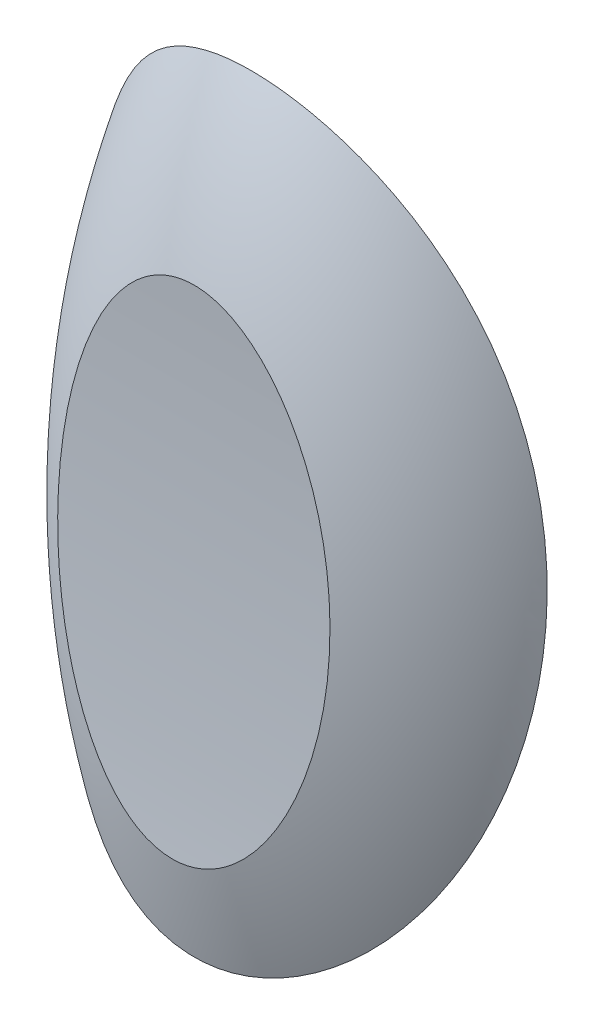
ISO-10303-21;
HEADER;
FILE_DESCRIPTION(('STEP AP214'),'2;1');
FILE_NAME('part.step','',(''),(''),'','','');
FILE_SCHEMA(('AUTOMOTIVE_DESIGN { 1 0 10303 214 1 1 1 1 }'));
ENDSEC;
DATA;
#1=APPLICATION_CONTEXT('core data for automotive mechanical design processes');
#2=APPLICATION_PROTOCOL_DEFINITION('international standard','automotive_design',2000,#1);
#3=PRODUCT_CONTEXT('',#1,'mechanical');
#4=PRODUCT('Part','Part','',(#3));
#5=PRODUCT_RELATED_PRODUCT_CATEGORY('part','',(#4));
#6=PRODUCT_DEFINITION_FORMATION('','',#4);
#7=PRODUCT_DEFINITION_CONTEXT('part definition',#1,'design');
#8=PRODUCT_DEFINITION('design','',#6,#7);
#9=PRODUCT_DEFINITION_SHAPE('','',#8);
#10=(LENGTH_UNIT() NAMED_UNIT(*) SI_UNIT(.MILLI.,.METRE.));
#11=(NAMED_UNIT(*) PLANE_ANGLE_UNIT() SI_UNIT($,.RADIAN.));
#12=(NAMED_UNIT(*) SI_UNIT($,.STERADIAN.) SOLID_ANGLE_UNIT());
#13=UNCERTAINTY_MEASURE_WITH_UNIT(LENGTH_MEASURE(1.E-05),#10,'distance_accuracy_value','');
#14=(GEOMETRIC_REPRESENTATION_CONTEXT(3) GLOBAL_UNCERTAINTY_ASSIGNED_CONTEXT((#13)) GLOBAL_UNIT_ASSIGNED_CONTEXT((#10,
#11,#12)) REPRESENTATION_CONTEXT('',''));
#15=CARTESIAN_POINT('',(0.,0.,0.));
#16=DIRECTION('',(0.,0.,1.));
#17=DIRECTION('',(1.,0.,0.));
#18=AXIS2_PLACEMENT_3D('',#15,#16,#17);
#19=CARTESIAN_POINT('',(-19.0366667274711,51.0993200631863,67.4577213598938));
#20=DIRECTION('',(1.,0.,0.));
#21=DIRECTION('',(0.,0.,-1.));
#22=AXIS2_PLACEMENT_3D('',#19,#20,#21);
#23=CYLINDRICAL_SURFACE('',#22,60.);
#24=CARTESIAN_POINT('',(-11.6934335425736,25.8126324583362,13.046477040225));
#25=CARTESIAN_POINT('',(-12.062273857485,26.2658681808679,12.8358440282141));
#26=CARTESIAN_POINT('',(-12.409221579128,26.7363365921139,12.6241140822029));
#27=CARTESIAN_POINT('',(-13.0613865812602,27.7066454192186,12.2031952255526));
#28=CARTESIAN_POINT('',(-13.3665832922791,28.2065001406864,11.9940076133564));
#29=CARTESIAN_POINT('',(-13.9380299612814,29.2322015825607,11.5816492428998));
#30=CARTESIAN_POINT('',(-14.2041761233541,29.7581127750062,11.3784956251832));
#31=CARTESIAN_POINT('',(-14.6988394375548,30.8307604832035,10.9819503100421));
#32=CARTESIAN_POINT('',(-14.9273571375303,31.3774966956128,10.7885584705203));
#33=CARTESIAN_POINT('',(-15.4362778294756,32.71841938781,10.3365475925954));
#34=CARTESIAN_POINT('',(-15.6990379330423,33.5214070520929,10.0840409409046));
#35=CARTESIAN_POINT('',(-16.1595922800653,35.1544812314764,9.60889916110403));
#36=CARTESIAN_POINT('',(-16.3573617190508,35.9845779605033,9.38627545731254));
#37=CARTESIAN_POINT('',(-16.6927608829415,37.6650736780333,8.97465102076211));
#38=CARTESIAN_POINT('',(-16.8303808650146,38.5154759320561,8.78565573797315));
#39=CARTESIAN_POINT('',(-17.049436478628,40.230494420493,8.44388179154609));
#40=CARTESIAN_POINT('',(-17.1308776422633,41.0951092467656,8.29109956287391));
#41=CARTESIAN_POINT('',(-17.2417676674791,42.8493253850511,8.02086833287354));
#42=CARTESIAN_POINT('',(-17.270240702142,43.7390947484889,7.90411493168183));
#43=CARTESIAN_POINT('',(-17.2746929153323,45.5230927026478,7.71066478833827));
#44=CARTESIAN_POINT('',(-17.2506707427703,46.4173214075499,7.6339690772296));
#45=CARTESIAN_POINT('',(-17.1516729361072,48.2062708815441,7.52080125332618));
#46=CARTESIAN_POINT('',(-17.0766515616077,49.1009913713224,7.48436532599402));
#47=CARTESIAN_POINT('',(-16.8763097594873,50.8856237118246,7.45146685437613));
#48=CARTESIAN_POINT('',(-16.7509876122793,51.7755353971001,7.45500567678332));
#49=CARTESIAN_POINT('',(-16.5132291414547,53.1731610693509,7.49137668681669));
#50=CARTESIAN_POINT('',(-16.4175536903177,53.6841561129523,7.5112583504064));
#51=CARTESIAN_POINT('',(-16.2090623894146,54.7019637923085,7.56381098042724));
#52=CARTESIAN_POINT('',(-16.0962478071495,55.208776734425,7.59648100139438));
#53=CARTESIAN_POINT('',(-15.8531271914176,56.2174354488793,7.67427143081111));
#54=CARTESIAN_POINT('',(-15.7228142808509,56.7192791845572,7.71939674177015));
#55=CARTESIAN_POINT('',(-15.4442963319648,57.7167393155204,7.82164934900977));
#56=CARTESIAN_POINT('',(-15.2960916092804,58.2123558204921,7.87877643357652));
#57=CARTESIAN_POINT('',(-14.981455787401,59.1954625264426,8.00439797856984));
#58=CARTESIAN_POINT('',(-14.815053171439,59.6829640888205,8.07287475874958));
#59=CARTESIAN_POINT('',(-14.4630988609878,60.6493850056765,8.22061131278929));
#60=CARTESIAN_POINT('',(-14.2775462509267,61.1283039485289,8.29987160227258));
#61=CARTESIAN_POINT('',(-13.8865268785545,62.075802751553,8.46833088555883));
#62=CARTESIAN_POINT('',(-13.6810732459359,62.5443891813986,8.55752333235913));
#63=CARTESIAN_POINT('',(-13.2491000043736,63.4698316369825,8.74491791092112));
#64=CARTESIAN_POINT('',(-13.0225838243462,63.9266895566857,8.8431185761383));
#65=CARTESIAN_POINT('',(-12.5327474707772,64.8541362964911,9.05357275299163));
#66=CARTESIAN_POINT('',(-12.2680285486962,65.323878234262,9.16631730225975));
#67=CARTESIAN_POINT('',(-11.7116185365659,66.2453022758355,9.39891545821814));
#68=CARTESIAN_POINT('',(-11.4199293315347,66.6969856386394,9.5187685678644));
#69=CARTESIAN_POINT('',(-10.8077719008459,67.5784858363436,9.76330141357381));
#70=CARTESIAN_POINT('',(-10.4873301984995,68.0083222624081,9.88797664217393));
#71=CARTESIAN_POINT('',(-9.81519566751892,68.8421906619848,10.1394871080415));
#72=CARTESIAN_POINT('',(-9.46351057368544,69.2462289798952,10.2663218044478));
#73=CARTESIAN_POINT('',(-8.82014257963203,69.9243409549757,10.4865743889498));
#74=CARTESIAN_POINT('',(-8.53589213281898,70.2053690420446,10.580301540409));
#75=CARTESIAN_POINT('',(-7.94777434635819,70.7471510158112,10.7651768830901));
#76=CARTESIAN_POINT('',(-7.64390673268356,71.007904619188,10.8563250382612));
#77=CARTESIAN_POINT('',(-7.01633685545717,71.5053692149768,11.033765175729));
#78=CARTESIAN_POINT('',(-6.69266063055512,71.7421107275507,11.1200632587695));
#79=CARTESIAN_POINT('',(-6.02497395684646,72.1878621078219,11.2853982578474));
#80=CARTESIAN_POINT('',(-5.68097043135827,72.3968813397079,11.3644376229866));
#81=CARTESIAN_POINT('',(-5.06618502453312,72.7319684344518,11.492984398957));
#82=CARTESIAN_POINT('',(-4.79989281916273,72.8654067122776,11.5447969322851));
#83=CARTESIAN_POINT('',(-4.25723260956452,73.1127474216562,11.6417142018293));
#84=CARTESIAN_POINT('',(-3.98086737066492,73.2266551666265,11.6868207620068));
#85=CARTESIAN_POINT('',(-3.41924030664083,73.432911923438,11.7690957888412));
#86=CARTESIAN_POINT('',(-3.13398481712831,73.5252759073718,11.8062697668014));
#87=CARTESIAN_POINT('',(-2.55589911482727,73.6866893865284,11.8715868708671));
#88=CARTESIAN_POINT('',(-2.26306886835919,73.7557387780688,11.8997299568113));
#89=CARTESIAN_POINT('',(-1.66956948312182,73.8693844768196,11.9462091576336));
#90=CARTESIAN_POINT('',(-1.36885757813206,73.9137901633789,11.9644687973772));
#91=CARTESIAN_POINT('',(-0.764231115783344,73.976214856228,11.990173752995));
#92=CARTESIAN_POINT('',(-0.460316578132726,73.9942340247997,11.9976191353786));
#93=CARTESIAN_POINT('',(0.147946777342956,74.0034097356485,12.0014079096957));
#94=CARTESIAN_POINT('',(0.452295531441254,73.9945698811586,11.9977527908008));
#95=CARTESIAN_POINT('',(1.05869793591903,73.9502682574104,11.9794847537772));
#96=CARTESIAN_POINT('',(1.36075169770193,73.914807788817,11.9648723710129));
#97=CARTESIAN_POINT('',(1.92803208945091,73.8233419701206,11.9273606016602));
#98=CARTESIAN_POINT('',(2.19375282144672,73.7699289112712,11.9055103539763));
#99=CARTESIAN_POINT('',(2.71971903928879,73.6436244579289,11.8541335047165));
#100=CARTESIAN_POINT('',(2.97996511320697,73.5707351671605,11.8246077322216));
#101=CARTESIAN_POINT('',(3.49378581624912,73.4067200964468,11.7586396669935));
#102=CARTESIAN_POINT('',(3.74735892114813,73.3155901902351,11.7221958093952));
#103=CARTESIAN_POINT('',(4.24685957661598,73.1164969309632,11.6432484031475));
#104=CARTESIAN_POINT('',(4.49278528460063,73.0085295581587,11.6007434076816));
#105=CARTESIAN_POINT('',(5.08815287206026,72.723689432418,11.4896986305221));
#106=CARTESIAN_POINT('',(5.43286957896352,72.5380419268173,11.4182094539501));
#107=CARTESIAN_POINT('',(6.10339589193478,72.13820921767,11.2668783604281));
#108=CARTESIAN_POINT('',(6.42919775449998,71.9240124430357,11.1870330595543));
#109=CARTESIAN_POINT('',(7.06226099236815,71.4706496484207,11.0213212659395));
#110=CARTESIAN_POINT('',(7.36948383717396,71.231434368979,10.9354430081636));
#111=CARTESIAN_POINT('',(7.96500648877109,70.7318974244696,10.759995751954));
#112=CARTESIAN_POINT('',(8.25330619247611,70.4715756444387,10.6704267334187));
#113=CARTESIAN_POINT('',(8.96742716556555,69.782503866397,10.4390044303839));
#114=CARTESIAN_POINT('',(9.38032078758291,69.3407585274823,10.2958388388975));
#115=CARTESIAN_POINT('',(10.1652957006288,68.4219924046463,10.0107297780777));
#116=CARTESIAN_POINT('',(10.5373541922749,67.9449521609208,9.86878703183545));
#117=CARTESIAN_POINT('',(11.244454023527,66.9615624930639,9.59019227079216));
#118=CARTESIAN_POINT('',(11.5794309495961,66.455164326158,9.45354972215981));
#119=CARTESIAN_POINT('',(12.2146666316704,65.4189771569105,9.18909042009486));
#120=CARTESIAN_POINT('',(12.514927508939,64.8891895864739,9.06127312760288));
#121=CARTESIAN_POINT('',(13.0136906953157,63.9424773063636,8.84690431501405));
#122=CARTESIAN_POINT('',(13.219098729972,63.5297080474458,8.75791583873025));
#123=CARTESIAN_POINT('',(13.6126119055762,62.6944754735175,8.58723614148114));
#124=CARTESIAN_POINT('',(13.8007153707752,62.2720112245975,8.50554562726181));
#125=CARTESIAN_POINT('',(14.1604711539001,61.4185378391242,8.35017555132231));
#126=CARTESIAN_POINT('',(14.3321180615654,60.9875259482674,8.27649862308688));
#127=CARTESIAN_POINT('',(14.6596031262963,60.1181254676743,8.13778408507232));
#128=CARTESIAN_POINT('',(14.8154396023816,59.6797360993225,8.07274739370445));
#129=CARTESIAN_POINT('',(15.1118797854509,58.7965332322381,7.95182609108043));
#130=CARTESIAN_POINT('',(15.252481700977,58.351718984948,7.89594255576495));
#131=CARTESIAN_POINT('',(15.5189015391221,57.4565831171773,7.79376007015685));
#132=CARTESIAN_POINT('',(15.6447181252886,57.0062610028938,7.74746198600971));
#133=CARTESIAN_POINT('',(16.0005050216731,55.6484800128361,7.62353064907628));
#134=CARTESIAN_POINT('',(16.2089234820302,54.7338726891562,7.56081419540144));
#135=CARTESIAN_POINT('',(16.5747423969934,52.868272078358,7.47634557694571));
#136=CARTESIAN_POINT('',(16.7306927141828,51.9169479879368,7.45568856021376));
#137=CARTESIAN_POINT('',(16.9847688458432,50.006636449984,7.46006939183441));
#138=CARTESIAN_POINT('',(17.082892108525,49.0476486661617,7.48510925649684));
#139=CARTESIAN_POINT('',(17.2208364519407,47.1269237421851,7.58163464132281));
#140=CARTESIAN_POINT('',(17.2606026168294,46.1651848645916,7.65316381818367));
#141=CARTESIAN_POINT('',(17.2799602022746,44.2455073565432,7.842664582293));
#142=CARTESIAN_POINT('',(17.2595510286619,43.2875687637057,7.96063662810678));
#143=CARTESIAN_POINT('',(17.1794066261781,41.8170389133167,8.17776078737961));
#144=CARTESIAN_POINT('',(17.1418731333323,41.3007460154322,8.26092544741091));
#145=CARTESIAN_POINT('',(17.047565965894,40.2722311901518,8.44038093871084));
#146=CARTESIAN_POINT('',(16.9907943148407,39.7600088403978,8.53667038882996));
#147=CARTESIAN_POINT('',(16.8572747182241,38.740511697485,8.74204707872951));
#148=CARTESIAN_POINT('',(16.7805177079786,38.2332392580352,8.85114011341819));
#149=CARTESIAN_POINT('',(16.6062319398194,37.2251480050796,9.08157363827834));
#150=CARTESIAN_POINT('',(16.5087061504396,36.7243282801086,9.20291237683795));
#151=CARTESIAN_POINT('',(16.2921870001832,35.7314724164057,9.45693476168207));
#152=CARTESIAN_POINT('',(16.1732412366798,35.2394194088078,9.58959291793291));
#153=CARTESIAN_POINT('',(15.9127033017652,34.2643716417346,9.86569717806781));
#154=CARTESIAN_POINT('',(15.7711099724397,33.7813773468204,10.0091438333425));
#155=CARTESIAN_POINT('',(15.4642581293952,32.8263946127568,10.3057312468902));
#156=CARTESIAN_POINT('',(15.2990169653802,32.3543983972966,10.4588648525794));
#157=CARTESIAN_POINT('',(14.9436029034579,31.4228981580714,10.7736839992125));
#158=CARTESIAN_POINT('',(14.753434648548,30.9633918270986,10.9353679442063));
#159=CARTESIAN_POINT('',(14.3217570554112,30.0029429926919,11.286239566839));
#160=CARTESIAN_POINT('',(14.0768085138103,29.5038765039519,11.4763605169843));
#161=CARTESIAN_POINT('',(13.5518912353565,28.5271188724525,11.863013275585));
#162=CARTESIAN_POINT('',(13.271927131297,28.0494249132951,12.0595442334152));
#163=CARTESIAN_POINT('',(12.6754253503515,27.1195988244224,12.4556485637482));
#164=CARTESIAN_POINT('',(12.3589325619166,26.667436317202,12.655217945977));
#165=CARTESIAN_POINT('',(11.6874131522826,25.7923713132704,13.0537755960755));
#166=CARTESIAN_POINT('',(11.3323946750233,25.3694626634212,13.2527639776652));
#167=CARTESIAN_POINT('',(10.6648628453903,24.6469179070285,13.6024110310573));
#168=CARTESIAN_POINT('',(10.3601142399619,24.3405936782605,13.7540942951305));
#169=CARTESIAN_POINT('',(9.72604452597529,23.751403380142,14.05172618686));
#170=CARTESIAN_POINT('',(9.39672478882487,23.4685360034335,14.197675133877));
#171=CARTESIAN_POINT('',(8.71391962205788,22.9294036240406,14.4808539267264));
#172=CARTESIAN_POINT('',(8.36045537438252,22.673115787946,14.6180912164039));
#173=CARTESIAN_POINT('',(7.62980197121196,22.1900034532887,14.8808535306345));
#174=CARTESIAN_POINT('',(7.25261725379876,21.963173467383,15.0063807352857));
#175=CARTESIAN_POINT('',(6.54645321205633,21.5804121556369,15.2210183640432));
#176=CARTESIAN_POINT('',(6.22114510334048,21.4190843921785,15.3126037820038));
#177=CARTESIAN_POINT('',(5.55683670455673,21.1201066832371,15.4839158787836));
#178=CARTESIAN_POINT('',(5.21783912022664,20.9824520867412,15.5636448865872));
#179=CARTESIAN_POINT('',(4.52787425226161,20.732529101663,15.7094946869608));
#180=CARTESIAN_POINT('',(4.17691107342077,20.6202521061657,15.7756200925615));
#181=CARTESIAN_POINT('',(3.46499834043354,20.4225430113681,15.8927276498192));
#182=CARTESIAN_POINT('',(3.1040486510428,20.337111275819,15.943709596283));
#183=CARTESIAN_POINT('',(2.37284278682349,20.1939889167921,16.0294458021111));
#184=CARTESIAN_POINT('',(2.0025487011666,20.1364411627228,16.0641164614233));
#185=CARTESIAN_POINT('',(1.25734882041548,20.050642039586,16.1159048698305));
#186=CARTESIAN_POINT('',(0.882443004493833,20.022390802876,16.1330225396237));
#187=CARTESIAN_POINT('',(0.131245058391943,19.9956483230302,16.1492244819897));
#188=CARTESIAN_POINT('',(-0.24504682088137,19.997151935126,16.1483118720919));
#189=CARTESIAN_POINT('',(-0.995840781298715,20.02988370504,16.1284851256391));
#190=CARTESIAN_POINT('',(-1.37034296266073,20.0611101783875,16.1095720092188));
#191=CARTESIAN_POINT('',(-2.08372834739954,20.1489874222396,16.0565611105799));
#192=CARTESIAN_POINT('',(-2.42300272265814,20.2033299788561,16.0238436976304));
#193=CARTESIAN_POINT('',(-3.0951640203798,20.3358780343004,15.9444551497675));
#194=CARTESIAN_POINT('',(-3.42805135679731,20.4140819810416,15.8977849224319));
#195=CARTESIAN_POINT('',(-4.08550414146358,20.5933873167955,15.7914953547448));
#196=CARTESIAN_POINT('',(-4.41006861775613,20.6944913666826,15.731874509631));
#197=CARTESIAN_POINT('',(-5.04916791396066,20.9184190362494,15.6008990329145));
#198=CARTESIAN_POINT('',(-5.36370228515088,21.0412436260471,15.5295438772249));
#199=CARTESIAN_POINT('',(-5.99791826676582,21.3144319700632,15.3723436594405));
#200=CARTESIAN_POINT('',(-6.31697401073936,21.4659180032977,15.2859273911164));
#201=CARTESIAN_POINT('',(-6.94134612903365,21.7899920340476,15.1031809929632));
#202=CARTESIAN_POINT('',(-7.24665718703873,21.9625881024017,15.0068470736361));
#203=CARTESIAN_POINT('',(-7.84249633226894,22.3271533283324,14.8059817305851));
#204=CARTESIAN_POINT('',(-8.13302898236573,22.5191164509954,14.7014528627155));
#205=CARTESIAN_POINT('',(-8.69894212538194,22.9208804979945,14.4857702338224));
#206=CARTESIAN_POINT('',(-8.97431887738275,23.1306857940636,14.3746148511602));
#207=CARTESIAN_POINT('',(-9.69464396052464,23.7172681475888,14.0686246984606));
#208=CARTESIAN_POINT('',(-10.1252974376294,24.1092553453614,13.8690359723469));
#209=CARTESIAN_POINT('',(-10.9422469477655,24.9327568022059,13.4621472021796));
#210=CARTESIAN_POINT('',(-11.3285527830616,25.3642622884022,13.2548488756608));
#211=CARTESIAN_POINT('',(-11.6934335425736,25.8126324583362,13.046477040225));
#212=B_SPLINE_CURVE_WITH_KNOTS('',3,(#24,#25,#26,#27,#28,#29,#30,#31,#32,#33,#34,#35,#36,#37,
#38,#39,#40,#41,#42,#43,#44,#45,#46,#47,#48,#49,#50,#51,#52,#53,#54,#55,#56,#57,#58,#59,#60,#61,
#62,#63,#64,#65,#66,#67,#68,#69,#70,#71,#72,#73,#74,#75,#76,#77,#78,#79,#80,#81,#82,#83,#84,#85,
#86,#87,#88,#89,#90,#91,#92,#93,#94,#95,#96,#97,#98,#99,#100,#101,#102,#103,#104,#105,#106,#107,
#108,#109,#110,#111,#112,#113,#114,#115,#116,#117,#118,#119,#120,#121,#122,#123,#124,#125,#126,
#127,#128,#129,#130,#131,#132,#133,#134,#135,#136,#137,#138,#139,#140,#141,#142,#143,#144,#145,
#146,#147,#148,#149,#150,#151,#152,#153,#154,#155,#156,#157,#158,#159,#160,#161,#162,#163,#164,
#165,#166,#167,#168,#169,#170,#171,#172,#173,#174,#175,#176,#177,#178,#179,#180,#181,#182,#183,
#184,#185,#186,#187,#188,#189,#190,#191,#192,#193,#194,#195,#196,#197,#198,#199,#200,#201,#202,
#203,#204,#205,#206,#207,#208,#209,#210,#211),.UNSPECIFIED.,.T.,.F.,(4,2,2,2,2,2,2,2,2,2,2,2,2,
2,2,2,2,2,2,2,2,2,2,2,2,2,2,2,2,2,2,2,2,2,2,2,2,2,2,2,2,2,2,2,2,2,2,2,2,2,2,2,2,2,2,2,2,2,2,2,2,
2,2,2,2,2,2,2,2,2,2,2,2,2,2,2,2,2,2,2,2,2,2,2,2,2,2,2,2,2,2,2,2,4),(0.,1.86286694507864,
3.72664838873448,5.59529732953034,7.46391906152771,10.1055563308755,12.7482006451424,
15.3912728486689,18.0340847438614,20.7251203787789,23.4162252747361,26.1097469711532,
28.8033607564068,30.3637316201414,31.9239871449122,33.4848576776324,35.0457006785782,
36.6041347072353,38.1626432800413,39.7201305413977,41.2773646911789,42.9290131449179,
44.5805462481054,46.2305712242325,47.880188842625,49.1110303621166,50.3418890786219,
51.5711631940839,52.8000210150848,53.7062308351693,54.6121937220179,55.5175251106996,
56.4228605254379,57.3351044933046,58.2473428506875,59.1594588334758,60.0715302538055,
60.8863992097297,61.701180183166,62.5161456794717,63.3313060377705,64.5234540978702,
65.7160868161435,66.9111135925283,68.106146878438,69.9673499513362,71.8295869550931,
73.6950096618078,75.5603183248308,76.9685456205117,78.376909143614,79.7857341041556,
81.1947086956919,82.6038487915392,84.0131161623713,86.8305894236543,89.7205318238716,
92.6106017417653,95.5033895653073,98.3962059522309,99.9686374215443,101.540903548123,
103.113884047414,104.686639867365,106.255943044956,107.825326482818,109.393564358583,
110.961510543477,112.722768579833,114.483793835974,116.242677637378,118.001190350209,
119.373868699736,120.746470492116,122.117883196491,123.4890400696,124.611406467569,
125.733552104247,126.855316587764,127.977096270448,129.104564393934,130.232037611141,
131.359315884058,132.486530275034,133.520816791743,134.555036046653,135.589375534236,
136.623761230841,137.713521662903,138.803700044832,139.893539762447,140.983647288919,
142.82692429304,144.669793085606),.UNSPECIFIED.);
#213=CARTESIAN_POINT('',(-11.6934335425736,25.8126324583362,13.046477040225));
#214=VERTEX_POINT('',#213);
#215=EDGE_CURVE('E11',#214,#214,#212,.T.);
#216=ORIENTED_EDGE('',*,*,#215,.T.);
#217=EDGE_LOOP('',(#216));
#218=FACE_BOUND('',#217,.T.);
#219=CARTESIAN_POINT('',(-679.140278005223,51.0993200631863,67.4577213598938));
#220=DIRECTION('',(-0.034899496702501,0.731690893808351,-0.680742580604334));
#221=DIRECTION('',(0.999390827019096,0.0255512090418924,-0.0237720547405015));
#222=AXIS2_PLACEMENT_3D('',#219,#220,#221);
#223=ELLIPSE('',#222,1719.22250087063,60.);
#224=CARTESIAN_POINT('',(0.,30.9214767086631,10.9523708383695));
#225=VERTEX_POINT('',#224);
#226=CARTESIAN_POINT('',(-1.5,30.8677932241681,10.9715697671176));
#227=VERTEX_POINT('',#226);
#228=EDGE_CURVE('E372',#225,#227,#223,.T.);
#229=ORIENTED_EDGE('',*,*,#228,.T.);
#230=CARTESIAN_POINT('',(-1.5,51.0993200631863,67.4577213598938));
#231=DIRECTION('',(1.,0.,0.));
#232=DIRECTION('',(0.,0.,-1.));
#233=AXIS2_PLACEMENT_3D('',#230,#231,#232);
#234=CIRCLE('',#233,60.);
#235=CARTESIAN_POINT('',(-1.5,28.9520626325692,11.6948395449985));
#236=VERTEX_POINT('',#235);
#237=EDGE_CURVE('E375',#227,#236,#234,.F.);
#238=ORIENTED_EDGE('',*,*,#237,.T.);
#239=CARTESIAN_POINT('',(621.86777143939,51.0993200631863,67.4577213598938));
#240=DIRECTION('',(-0.034899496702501,-0.731690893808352,0.680742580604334));
#241=DIRECTION('',(0.999390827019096,-0.0255512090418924,0.0237720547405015));
#242=AXIS2_PLACEMENT_3D('',#239,#240,#241);
#243=ELLIPSE('',#242,1719.22250087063,60.);
#244=CARTESIAN_POINT('',(0.,28.8998402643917,11.7156089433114));
#245=VERTEX_POINT('',#244);
#246=EDGE_CURVE('E369',#245,#236,#243,.F.);
#247=ORIENTED_EDGE('',*,*,#246,.F.);
#248=CARTESIAN_POINT('',(-621.86777143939,51.0993200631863,67.4577213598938));
#249=DIRECTION('',(0.034899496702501,-0.731690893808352,0.680742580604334));
#250=DIRECTION('',(0.999390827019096,0.0255512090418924,-0.0237720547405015));
#251=AXIS2_PLACEMENT_3D('',#248,#249,#250);
#252=ELLIPSE('',#251,1719.22250087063,60.);
#253=CARTESIAN_POINT('',(1.5,28.9520626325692,11.6948395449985));
#254=VERTEX_POINT('',#253);
#255=EDGE_CURVE('E366',#245,#254,#252,.T.);
#256=ORIENTED_EDGE('',*,*,#255,.T.);
#257=CARTESIAN_POINT('',(1.5,51.0993200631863,67.4577213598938));
#258=DIRECTION('',(1.,0.,0.));
#259=DIRECTION('',(0.,0.,-1.));
#260=AXIS2_PLACEMENT_3D('',#257,#258,#259);
#261=CIRCLE('',#260,60.);
#262=CARTESIAN_POINT('',(1.5,30.8677932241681,10.9715697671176));
#263=VERTEX_POINT('',#262);
#264=EDGE_CURVE('E361',#263,#254,#261,.F.);
#265=ORIENTED_EDGE('',*,*,#264,.F.);
#266=CARTESIAN_POINT('',(679.140278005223,51.0993200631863,67.4577213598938));
#267=DIRECTION('',(0.034899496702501,0.731690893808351,-0.680742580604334));
#268=DIRECTION('',(0.999390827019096,-0.0255512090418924,0.0237720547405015));
#269=AXIS2_PLACEMENT_3D('',#266,#267,#268);
#270=ELLIPSE('',#269,1719.22250087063,60.);
#271=EDGE_CURVE('E363',#225,#263,#270,.F.);
#272=ORIENTED_EDGE('',*,*,#271,.F.);
#273=EDGE_LOOP('',(#229,#238,#247,#256,#265,#272));
#274=FACE_BOUND('',#273,.T.);
#275=CARTESIAN_POINT('',(346.479193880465,51.0993200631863,67.4577213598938));
#276=DIRECTION('',(-0.034899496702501,0.999390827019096,0.));
#277=DIRECTION('',(0.999390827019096,0.034899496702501,0.));
#278=AXIS2_PLACEMENT_3D('',#275,#276,#277);
#279=ELLIPSE('',#278,1719.22250087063,60.);
#280=CARTESIAN_POINT('',(0.,39.,8.69032858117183));
#281=VERTEX_POINT('',#280);
#282=CARTESIAN_POINT('',(-1.5,38.9476188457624,8.70113740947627));
#283=VERTEX_POINT('',#282);
#284=EDGE_CURVE('E383',#281,#283,#279,.T.);
#285=ORIENTED_EDGE('',*,*,#284,.T.);
#286=CARTESIAN_POINT('',(-1.5,37.0523811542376,9.12519606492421));
#287=VERTEX_POINT('',#286);
#288=EDGE_CURVE('E378',#283,#287,#234,.F.);
#289=ORIENTED_EDGE('',*,*,#288,.T.);
#290=CARTESIAN_POINT('',(-403.751700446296,51.0993200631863,67.4577213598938));
#291=DIRECTION('',(-0.034899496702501,-0.999390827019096,0.));
#292=DIRECTION('',(0.999390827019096,-0.034899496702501,0.));
#293=AXIS2_PLACEMENT_3D('',#290,#291,#292);
#294=ELLIPSE('',#293,1719.22250087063,60.);
#295=CARTESIAN_POINT('',(0.,37.,9.13783475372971));
#296=VERTEX_POINT('',#295);
#297=EDGE_CURVE('E386',#296,#287,#294,.F.);
#298=ORIENTED_EDGE('',*,*,#297,.F.);
#299=CARTESIAN_POINT('',(403.751700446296,51.0993200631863,67.4577213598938));
#300=DIRECTION('',(0.034899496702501,-0.999390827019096,0.));
#301=DIRECTION('',(0.999390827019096,0.034899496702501,0.));
#302=AXIS2_PLACEMENT_3D('',#299,#300,#301);
#303=ELLIPSE('',#302,1719.22250087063,60.);
#304=CARTESIAN_POINT('',(1.5,37.0523811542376,9.1251960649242));
#305=VERTEX_POINT('',#304);
#306=EDGE_CURVE('E379',#296,#305,#303,.T.);
#307=ORIENTED_EDGE('',*,*,#306,.T.);
#308=CARTESIAN_POINT('',(1.5,38.9476188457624,8.70113740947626));
#309=VERTEX_POINT('',#308);
#310=EDGE_CURVE('E364',#309,#305,#261,.F.);
#311=ORIENTED_EDGE('',*,*,#310,.F.);
#312=CARTESIAN_POINT('',(-346.479193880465,51.0993200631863,67.4577213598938));
#313=DIRECTION('',(0.034899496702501,0.999390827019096,0.));
#314=DIRECTION('',(0.999390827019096,-0.034899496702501,0.));
#315=AXIS2_PLACEMENT_3D('',#312,#313,#314);
#316=ELLIPSE('',#315,1719.22250087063,60.);
#317=EDGE_CURVE('E225',#281,#309,#316,.F.);
#318=ORIENTED_EDGE('',*,*,#317,.F.);
#319=EDGE_LOOP('',(#285,#289,#298,#307,#311,#318));
#320=FACE_BOUND('',#319,.T.);
#321=CARTESIAN_POINT('',(404.343516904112,51.0993200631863,67.4577213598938));
#322=DIRECTION('',(-0.034899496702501,0.925361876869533,0.377475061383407));
#323=DIRECTION('',(0.999390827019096,0.0323143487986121,0.0131817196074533));
#324=AXIS2_PLACEMENT_3D('',#321,#322,#323);
#325=ELLIPSE('',#324,1719.22250087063,60.);
#326=CARTESIAN_POINT('',(-1.5,59.9977901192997,8.12124665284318));
#327=VERTEX_POINT('',#326);
#328=CARTESIAN_POINT('',(0.,60.0510911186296,8.12926448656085));
#329=VERTEX_POINT('',#328);
#330=EDGE_CURVE('E341',#327,#329,#325,.F.);
#331=ORIENTED_EDGE('',*,*,#330,.F.);
#332=CARTESIAN_POINT('',(-1.5,51.0993200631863,67.4577213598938));
#333=DIRECTION('',(1.,0.,0.));
#334=DIRECTION('',(0.,0.,-1.));
#335=AXIS2_PLACEMENT_3D('',#332,#333,#334);
#336=CIRCLE('',#335,60.);
#337=CARTESIAN_POINT('',(-1.5,58.0565062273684,7.86243999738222));
#338=VERTEX_POINT('',#337);
#339=EDGE_CURVE('E347',#327,#338,#336,.F.);
#340=ORIENTED_EDGE('',*,*,#339,.T.);
#341=CARTESIAN_POINT('',(-461.616023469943,51.0993200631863,67.4577213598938));
#342=DIRECTION('',(-0.034899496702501,-0.925361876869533,-0.377475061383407));
#343=DIRECTION('',(0.999390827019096,-0.0323143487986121,-0.0131817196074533));
#344=AXIS2_PLACEMENT_3D('',#341,#342,#343);
#345=ELLIPSE('',#344,1719.22250087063,60.);
#346=CARTESIAN_POINT('',(0.,58.0024964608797,7.85615967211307));
#347=VERTEX_POINT('',#346);
#348=EDGE_CURVE('E344',#338,#347,#345,.T.);
#349=ORIENTED_EDGE('',*,*,#348,.T.);
#350=CARTESIAN_POINT('',(461.616023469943,51.0993200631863,67.4577213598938));
#351=DIRECTION('',(0.034899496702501,-0.925361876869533,-0.377475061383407));
#352=DIRECTION('',(0.999390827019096,0.0323143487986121,0.0131817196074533));
#353=AXIS2_PLACEMENT_3D('',#350,#351,#352);
#354=ELLIPSE('',#353,1719.22250087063,60.);
#355=CARTESIAN_POINT('',(1.5,58.0565062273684,7.86243999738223));
#356=VERTEX_POINT('',#355);
#357=EDGE_CURVE('E336',#356,#347,#354,.F.);
#358=ORIENTED_EDGE('',*,*,#357,.F.);
#359=CARTESIAN_POINT('',(1.5,51.0993200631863,67.4577213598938));
#360=DIRECTION('',(1.,0.,0.));
#361=DIRECTION('',(0.,0.,-1.));
#362=AXIS2_PLACEMENT_3D('',#359,#360,#361);
#363=CIRCLE('',#362,60.);
#364=CARTESIAN_POINT('',(1.5,59.9977901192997,8.12124665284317));
#365=VERTEX_POINT('',#364);
#366=EDGE_CURVE('E322',#365,#356,#363,.F.);
#367=ORIENTED_EDGE('',*,*,#366,.F.);
#368=CARTESIAN_POINT('',(-404.343516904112,51.0993200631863,67.4577213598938));
#369=DIRECTION('',(0.034899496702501,0.925361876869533,0.377475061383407));
#370=DIRECTION('',(0.999390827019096,-0.0323143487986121,-0.0131817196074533));
#371=AXIS2_PLACEMENT_3D('',#368,#369,#370);
#372=ELLIPSE('',#371,1719.22250087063,60.);
#373=EDGE_CURVE('E60',#365,#329,#372,.T.);
#374=ORIENTED_EDGE('',*,*,#373,.T.);
#375=EDGE_LOOP('',(#331,#340,#349,#358,#367,#374));
#376=FACE_BOUND('',#375,.T.);
#377=CARTESIAN_POINT('',(-598.660467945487,51.0993200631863,67.4577213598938));
#378=DIRECTION('',(-0.034899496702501,0.925361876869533,-0.377475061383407));
#379=DIRECTION('',(0.999390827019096,0.0323143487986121,-0.0131817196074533));
#380=AXIS2_PLACEMENT_3D('',#377,#378,#379);
#381=ELLIPSE('',#380,1719.22250087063,60.);
#382=CARTESIAN_POINT('',(0.,49.2142478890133,7.4873411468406));
#383=VERTEX_POINT('',#382);
#384=CARTESIAN_POINT('',(-1.5,49.1584029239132,7.48912257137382));
#385=VERTEX_POINT('',#384);
#386=EDGE_CURVE('E358',#383,#385,#381,.T.);
#387=ORIENTED_EDGE('',*,*,#386,.T.);
#388=CARTESIAN_POINT('',(-1.5,47.1517670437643,7.58772198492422));
#389=VERTEX_POINT('',#388);
#390=EDGE_CURVE('E350',#385,#389,#336,.F.);
#391=ORIENTED_EDGE('',*,*,#390,.T.);
#392=CARTESIAN_POINT('',(541.387961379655,51.0993200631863,67.4577213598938));
#393=DIRECTION('',(-0.034899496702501,-0.925361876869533,0.377475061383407));
#394=DIRECTION('',(0.999390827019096,-0.0323143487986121,0.0131817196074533));
#395=AXIS2_PLACEMENT_3D('',#392,#393,#394);
#396=ELLIPSE('',#395,1719.22250087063,60.);
#397=CARTESIAN_POINT('',(0.,47.0966872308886,7.59137914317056));
#398=VERTEX_POINT('',#397);
#399=EDGE_CURVE('E355',#398,#389,#396,.F.);
#400=ORIENTED_EDGE('',*,*,#399,.F.);
#401=CARTESIAN_POINT('',(-541.387961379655,51.0993200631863,67.4577213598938));
#402=DIRECTION('',(0.034899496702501,-0.925361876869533,0.377475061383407));
#403=DIRECTION('',(0.999390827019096,0.0323143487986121,-0.0131817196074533));
#404=AXIS2_PLACEMENT_3D('',#401,#402,#403);
#405=ELLIPSE('',#404,1719.22250087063,60.);
#406=CARTESIAN_POINT('',(1.5,47.1517670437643,7.58772198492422));
#407=VERTEX_POINT('',#406);
#408=EDGE_CURVE('E352',#398,#407,#405,.T.);
#409=ORIENTED_EDGE('',*,*,#408,.T.);
#410=CARTESIAN_POINT('',(1.5,49.1584029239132,7.4891225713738));
#411=VERTEX_POINT('',#410);
#412=EDGE_CURVE('E337',#411,#407,#363,.F.);
#413=ORIENTED_EDGE('',*,*,#412,.F.);
#414=CARTESIAN_POINT('',(598.660467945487,51.0993200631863,67.4577213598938));
#415=DIRECTION('',(0.034899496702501,0.925361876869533,-0.377475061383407));
#416=DIRECTION('',(0.999390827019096,-0.0323143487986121,0.0131817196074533));
#417=AXIS2_PLACEMENT_3D('',#414,#415,#416);
#418=ELLIPSE('',#417,1719.22250087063,60.);
#419=EDGE_CURVE('E52',#383,#411,#418,.F.);
#420=ORIENTED_EDGE('',*,*,#419,.F.);
#421=EDGE_LOOP('',(#387,#391,#400,#409,#413,#420));
#422=FACE_BOUND('',#421,.T.);
#423=ADVANCED_FACE('F34',(#218,#274,#320,#376,#422),#23,.T.);
#424=CARTESIAN_POINT('',(-19.0266667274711,53.7193366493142,215.953746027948));
#425=DIRECTION('',(1.,0.,0.));
#426=DIRECTION('',(0.,0.,-1.));
#427=AXIS2_PLACEMENT_3D('',#424,#425,#426);
#428=CYLINDRICAL_SURFACE('',#427,200.);
#429=CARTESIAN_POINT('',(-7.72043957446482,33.5090740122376,16.9775024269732));
#430=CARTESIAN_POINT('',(-7.47341911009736,32.970534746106,17.0322042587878));
#431=CARTESIAN_POINT('',(-7.20158457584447,32.4432461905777,17.0879841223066));
#432=CARTESIAN_POINT('',(-6.75160292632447,31.6765659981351,17.1719991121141));
#433=CARTESIAN_POINT('',(-6.5943805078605,31.4247926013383,17.2000917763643));
#434=CARTESIAN_POINT('',(-6.26490240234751,30.93129914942,17.2560688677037));
#435=CARTESIAN_POINT('',(-6.09265069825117,30.689576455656,17.2839533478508));
#436=CARTESIAN_POINT('',(-5.72980185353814,30.215421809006,17.3394878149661));
#437=CARTESIAN_POINT('',(-5.53900700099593,29.983138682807,17.3671308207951));
#438=CARTESIAN_POINT('',(-5.13991651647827,29.53408335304,17.4213179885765));
#439=CARTESIAN_POINT('',(-4.93161678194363,29.3173148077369,17.4478618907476));
#440=CARTESIAN_POINT('',(-4.27998718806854,28.6969564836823,17.5247874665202));
#441=CARTESIAN_POINT('',(-3.80820482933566,28.3209679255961,17.5727410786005));
#442=CARTESIAN_POINT('',(-3.00166198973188,27.8188960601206,17.6378285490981));
#443=CARTESIAN_POINT('',(-2.69152999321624,27.6539155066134,17.659485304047));
#444=CARTESIAN_POINT('',(-2.20966296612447,27.4443886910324,17.6871780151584));
#445=CARTESIAN_POINT('',(-2.04625264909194,27.3808678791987,17.6956105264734));
#446=CARTESIAN_POINT('',(-1.71464217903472,27.2677184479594,17.7106750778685));
#447=CARTESIAN_POINT('',(-1.54644399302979,27.2180842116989,17.7173078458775));
#448=CARTESIAN_POINT('',(-1.2047572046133,27.133453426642,17.7286400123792));
#449=CARTESIAN_POINT('',(-1.03123519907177,27.0985886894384,17.7333219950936));
#450=CARTESIAN_POINT('',(-0.681738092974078,27.0450335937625,17.7405217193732));
#451=CARTESIAN_POINT('',(-0.50576417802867,27.0263356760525,17.7430404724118));
#452=CARTESIAN_POINT('',(-0.152816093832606,27.0056099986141,17.7458326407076));
#453=CARTESIAN_POINT('',(0.0241580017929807,27.0035810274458,17.7461062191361));
#454=CARTESIAN_POINT('',(0.377443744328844,27.0162178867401,17.7444035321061));
#455=CARTESIAN_POINT('',(0.553755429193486,27.0308827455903,17.7424273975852));
#456=CARTESIAN_POINT('',(1.04313162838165,27.0947062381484,17.7338403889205));
#457=CARTESIAN_POINT('',(1.35395023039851,27.1619820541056,17.7247987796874));
#458=CARTESIAN_POINT('',(1.96090495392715,27.3437137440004,17.7005374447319));
#459=CARTESIAN_POINT('',(2.25703347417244,27.4581937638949,17.6853145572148));
#460=CARTESIAN_POINT('',(2.94419814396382,27.780287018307,17.6428756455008));
#461=CARTESIAN_POINT('',(3.32619381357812,28.0068317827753,17.6132976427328));
#462=CARTESIAN_POINT('',(4.04900634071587,28.517465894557,17.547768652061));
#463=CARTESIAN_POINT('',(4.38972491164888,28.8016884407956,17.5118029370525));
#464=CARTESIAN_POINT('',(4.95900221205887,29.3431863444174,17.4446518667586));
#465=CARTESIAN_POINT('',(5.19560354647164,29.5922732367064,17.4141962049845));
#466=CARTESIAN_POINT('',(5.64616346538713,30.1101405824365,17.3519488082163));
#467=CARTESIAN_POINT('',(5.86010924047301,30.378932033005,17.3201563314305));
#468=CARTESIAN_POINT('',(6.26713120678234,30.9322870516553,17.2559149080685));
#469=CARTESIAN_POINT('',(6.46017707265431,31.2168726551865,17.2234650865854));
#470=CARTESIAN_POINT('',(6.82669738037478,31.7984169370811,17.1584768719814));
#471=CARTESIAN_POINT('',(7.00016499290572,32.0953798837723,17.1259384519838));
#472=CARTESIAN_POINT('',(7.44107468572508,32.9051526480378,17.0391160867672));
#473=CARTESIAN_POINT('',(7.69193525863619,33.427061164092,16.9851342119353));
#474=CARTESIAN_POINT('',(8.14797277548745,34.4907555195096,16.8795185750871));
#475=CARTESIAN_POINT('',(8.35311994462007,35.0325540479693,16.8278863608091));
#476=CARTESIAN_POINT('',(8.72216692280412,36.1311833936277,16.7278402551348));
#477=CARTESIAN_POINT('',(8.88600116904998,36.6880365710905,16.679431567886));
#478=CARTESIAN_POINT('',(9.17516695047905,37.8117796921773,16.5865778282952));
#479=CARTESIAN_POINT('',(9.30050313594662,38.3786684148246,16.5421322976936));
#480=CARTESIAN_POINT('',(9.56178984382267,39.7677503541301,16.4392698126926));
#481=CARTESIAN_POINT('',(9.67864724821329,40.593746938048,16.3831838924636));
#482=CARTESIAN_POINT('',(9.84266954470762,42.2534432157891,16.2809501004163));
#483=CARTESIAN_POINT('',(9.88980068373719,43.0871464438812,16.2348070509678));
#484=CARTESIAN_POINT('',(9.91655160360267,44.75670301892,16.1529196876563));
#485=CARTESIAN_POINT('',(9.89612423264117,45.5925574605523,16.1171826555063));
#486=CARTESIAN_POINT('',(9.78797037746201,47.2600402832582,16.0563398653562));
#487=CARTESIAN_POINT('',(9.70027046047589,48.0916702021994,16.0312299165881));
#488=CARTESIAN_POINT('',(9.48438798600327,49.5519067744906,15.9961637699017));
#489=CARTESIAN_POINT('',(9.37043360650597,50.1825909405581,15.9840384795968));
#490=CARTESIAN_POINT('',(9.1001610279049,51.4351121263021,15.9658104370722));
#491=CARTESIAN_POINT('',(8.943836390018,52.0569477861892,15.9597086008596));
#492=CARTESIAN_POINT('',(8.58658991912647,53.2857463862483,15.9532748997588));
#493=CARTESIAN_POINT('',(8.38580317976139,53.8927483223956,15.9529257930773));
#494=CARTESIAN_POINT('',(7.93528994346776,55.0881832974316,15.9575394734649));
#495=CARTESIAN_POINT('',(7.68559684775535,55.67662869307,15.9624986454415));
#496=CARTESIAN_POINT('',(7.27199811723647,56.5347898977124,15.9733626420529));
#497=CARTESIAN_POINT('',(7.12890177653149,56.8146426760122,15.9775089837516));
#498=CARTESIAN_POINT('',(6.82840753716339,57.3665165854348,15.9868135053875));
#499=CARTESIAN_POINT('',(6.67101292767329,57.6385394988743,15.9919714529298));
#500=CARTESIAN_POINT('',(6.3407270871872,58.1731984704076,16.0031654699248));
#501=CARTESIAN_POINT('',(6.16782876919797,58.4358301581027,16.0092019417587));
#502=CARTESIAN_POINT('',(5.80531986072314,58.9493044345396,16.0219743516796));
#503=CARTESIAN_POINT('',(5.6157120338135,59.2001489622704,16.0287101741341));
#504=CARTESIAN_POINT('',(5.25641414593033,59.6404211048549,16.0413162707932));
#505=CARTESIAN_POINT('',(5.08986510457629,59.832409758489,16.0471052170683));
#506=CARTESIAN_POINT('',(4.74409014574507,60.2047105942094,16.0588371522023));
#507=CARTESIAN_POINT('',(4.56486294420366,60.3850215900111,16.0647801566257));
#508=CARTESIAN_POINT('',(4.1933689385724,60.7310160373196,16.0766181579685));
#509=CARTESIAN_POINT('',(4.00112916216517,60.8967282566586,16.082513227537));
#510=CARTESIAN_POINT('',(3.60288008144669,61.2106510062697,16.094032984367));
#511=CARTESIAN_POINT('',(3.39687275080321,61.3588640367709,16.0996577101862));
#512=CARTESIAN_POINT('',(2.90157693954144,61.6786243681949,16.1121014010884));
#513=CARTESIAN_POINT('',(2.60693215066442,61.8421717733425,16.1187167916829));
#514=CARTESIAN_POINT('',(2.14864838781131,62.0511823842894,16.1273582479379));
#515=CARTESIAN_POINT('',(1.99316250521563,62.1148022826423,16.1300251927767));
#516=CARTESIAN_POINT('',(1.67736585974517,62.2286245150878,16.1348398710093));
#517=CARTESIAN_POINT('',(1.51705727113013,62.2788327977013,16.136987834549));
#518=CARTESIAN_POINT('',(1.19085204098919,62.3650365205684,16.140698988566));
#519=CARTESIAN_POINT('',(1.02491463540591,62.4008788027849,16.1422558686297));
#520=CARTESIAN_POINT('',(0.690438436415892,62.456560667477,16.1446829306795));
#521=CARTESIAN_POINT('',(0.521900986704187,62.4764082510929,16.1455534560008));
#522=CARTESIAN_POINT('',(0.183710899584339,62.4995013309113,16.1465668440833));
#523=CARTESIAN_POINT('',(0.0140585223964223,62.5027505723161,16.1467098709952));
#524=CARTESIAN_POINT('',(-0.324690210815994,62.4925816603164,16.146263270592));
#525=CARTESIAN_POINT('',(-0.493786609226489,62.4791648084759,16.1456737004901));
#526=CARTESIAN_POINT('',(-0.954795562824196,62.4199594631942,16.1430837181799));
#527=CARTESIAN_POINT('',(-1.24470320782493,62.3575345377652,16.1403609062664));
#528=CARTESIAN_POINT('',(-1.81101077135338,62.188472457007,16.1331246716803));
#529=CARTESIAN_POINT('',(-2.08740288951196,62.081810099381,16.1286102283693));
#530=CARTESIAN_POINT('',(-2.73866169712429,61.7775072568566,16.1160674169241));
#531=CARTESIAN_POINT('',(-3.10442151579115,61.5604705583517,16.1073637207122));
#532=CARTESIAN_POINT('',(-3.79720300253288,61.0715061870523,16.0887780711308));
#533=CARTESIAN_POINT('',(-4.12412424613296,60.7994409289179,16.0788931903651));
#534=CARTESIAN_POINT('',(-4.68204093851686,60.2720294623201,16.0609791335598));
#535=CARTESIAN_POINT('',(-4.91945722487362,60.0233379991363,16.0529544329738));
#536=CARTESIAN_POINT('',(-5.37194606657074,59.506229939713,16.037316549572));
#537=CARTESIAN_POINT('',(-5.58700428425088,59.2378008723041,16.029703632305));
#538=CARTESIAN_POINT('',(-5.99683103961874,58.6853477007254,16.0152173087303));
#539=CARTESIAN_POINT('',(-6.19156815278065,58.4013004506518,16.0083450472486));
#540=CARTESIAN_POINT('',(-6.56221653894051,57.8210785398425,15.9956004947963));
#541=CARTESIAN_POINT('',(-6.73812108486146,57.5248995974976,15.9897285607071));
#542=CARTESIAN_POINT('',(-7.05217821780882,56.9595543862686,15.9798204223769));
#543=CARTESIAN_POINT('',(-7.19231980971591,56.6914882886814,15.9756477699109));
#544=CARTESIAN_POINT('',(-7.46006520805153,56.1491340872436,15.9683222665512));
#545=CARTESIAN_POINT('',(-7.58766715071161,55.8748450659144,15.9651695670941));
#546=CARTESIAN_POINT('',(-7.952905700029,55.0439309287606,15.9573662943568));
#547=CARTESIAN_POINT('',(-8.17286824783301,54.4794545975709,15.954374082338));
#548=CARTESIAN_POINT('',(-8.57045058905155,53.3349361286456,15.9532944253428));
#549=CARTESIAN_POINT('',(-8.74799799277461,52.754869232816,15.9552153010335));
#550=CARTESIAN_POINT('',(-9.06343237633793,51.5842717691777,15.9642858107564));
#551=CARTESIAN_POINT('',(-9.20132553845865,50.9937428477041,15.9714346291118));
#552=CARTESIAN_POINT('',(-9.48727739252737,49.5678429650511,15.9951097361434));
#553=CARTESIAN_POINT('',(-9.6173989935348,48.7288844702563,16.0142410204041));
#554=CARTESIAN_POINT('',(-9.80762439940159,47.0431312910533,16.0634258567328));
#555=CARTESIAN_POINT('',(-9.8676950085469,46.1963330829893,16.0934845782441));
#556=CARTESIAN_POINT('',(-9.91860138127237,44.5010453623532,16.1644997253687));
#557=CARTESIAN_POINT('',(-9.90943143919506,43.6525557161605,16.2054570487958));
#558=CARTESIAN_POINT('',(-9.82065984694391,41.9600990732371,16.2979477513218));
#559=CARTESIAN_POINT('',(-9.74109170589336,41.1161301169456,16.3494760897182));
#560=CARTESIAN_POINT('',(-9.54350868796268,39.6936744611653,16.4452901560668));
#561=CARTESIAN_POINT('',(-9.44448447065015,39.1123335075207,16.4870295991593));
#562=CARTESIAN_POINT('',(-9.20867597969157,37.9575600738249,16.5749570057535));
#563=CARTESIAN_POINT('',(-9.07188868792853,37.3841282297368,16.621145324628));
#564=CARTESIAN_POINT('',(-8.75840751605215,36.2505166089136,16.7172966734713));
#565=CARTESIAN_POINT('',(-8.5818446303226,35.6902998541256,16.7672469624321));
#566=CARTESIAN_POINT('',(-8.18508655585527,34.5860792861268,16.8702815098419));
#567=CARTESIAN_POINT('',(-7.96491584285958,34.0420665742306,16.9233639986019));
#568=CARTESIAN_POINT('',(-7.72043957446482,33.5090740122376,16.9775024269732));
#569=B_SPLINE_CURVE_WITH_KNOTS('',3,(#429,#430,#431,#432,#433,#434,#435,#436,#437,#438,#439,
#440,#441,#442,#443,#444,#445,#446,#447,#448,#449,#450,#451,#452,#453,#454,#455,#456,#457,#458,
#459,#460,#461,#462,#463,#464,#465,#466,#467,#468,#469,#470,#471,#472,#473,#474,#475,#476,#477,
#478,#479,#480,#481,#482,#483,#484,#485,#486,#487,#488,#489,#490,#491,#492,#493,#494,#495,#496,
#497,#498,#499,#500,#501,#502,#503,#504,#505,#506,#507,#508,#509,#510,#511,#512,#513,#514,#515,
#516,#517,#518,#519,#520,#521,#522,#523,#524,#525,#526,#527,#528,#529,#530,#531,#532,#533,#534,
#535,#536,#537,#538,#539,#540,#541,#542,#543,#544,#545,#546,#547,#548,#549,#550,#551,#552,#553,
#554,#555,#556,#557,#558,#559,#560,#561,#562,#563,#564,#565,#566,#567,#568),.UNSPECIFIED.,.T.,
.F.,(4,2,2,2,2,2,2,2,2,2,2,2,2,2,2,2,2,2,2,2,2,2,2,2,2,2,2,2,2,2,2,2,2,2,2,2,2,2,2,2,2,2,2,2,2,
2,2,2,2,2,2,2,2,2,2,2,2,2,2,2,2,2,2,2,2,2,2,2,2,4),(0.,1.78422981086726,2.6782530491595,
3.57204007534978,4.4767019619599,5.38157646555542,7.182647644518,8.23458024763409,
8.7606065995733,9.28641987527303,9.81683170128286,10.3469953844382,10.8771205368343,
11.4072148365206,12.3569956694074,13.3072629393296,14.6350997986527,15.9660387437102,
16.999331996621,18.0332063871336,19.0685613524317,20.1042763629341,21.8462629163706,
23.5893807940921,25.3352477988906,27.0809038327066,29.5858069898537,32.0919223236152,
34.5997871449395,37.1066620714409,39.028369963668,40.9503700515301,42.8666085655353,
44.7815428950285,45.7242322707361,46.6667053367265,47.6096114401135,48.5523618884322,
49.3145411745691,50.0767977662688,50.8375170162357,51.5981274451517,52.6051901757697,
53.1087535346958,53.6120931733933,54.1206647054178,54.6289816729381,55.137183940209,
55.6453465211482,56.5307088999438,57.4165763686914,58.6855578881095,59.9577522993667,
60.9880858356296,62.0190760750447,63.0516377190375,64.0845669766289,64.9917672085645,
65.8991020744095,67.714438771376,69.5328519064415,71.3509813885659,73.895279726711,
76.440783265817,78.986496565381,81.5309987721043,83.3034535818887,85.076050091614,
86.8428920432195,88.60874511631),.UNSPECIFIED.);
#570=CARTESIAN_POINT('',(-7.72043957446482,33.5090740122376,16.9775024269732));
#571=VERTEX_POINT('',#570);
#572=EDGE_CURVE('E45',#571,#571,#569,.T.);
#573=ORIENTED_EDGE('',*,*,#572,.T.);
#574=EDGE_LOOP('',(#573));
#575=FACE_BOUND('',#574,.T.);
#576=ADVANCED_FACE('F395',(#575),#428,.F.);
#577=CARTESIAN_POINT('',(0.,41.25,0.));
#578=DIRECTION('',(0.,1.,0.));
#579=DIRECTION('',(0.,0.,1.));
#580=AXIS2_PLACEMENT_3D('',#577,#578,#579);
#581=DEGENERATE_TOROIDAL_SURFACE('',#580,60.8075269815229,79.834193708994,.F.);
#582=ORIENTED_EDGE('',*,*,#572,.F.);
#583=EDGE_LOOP('',(#582));
#584=FACE_BOUND('',#583,.T.);
#585=ORIENTED_EDGE('',*,*,#215,.F.);
#586=EDGE_LOOP('',(#585));
#587=FACE_BOUND('',#586,.T.);
#588=ADVANCED_FACE('F393',(#584,#587),#581,.F.);
#589=CARTESIAN_POINT('',(0.,8.57955591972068,23.5721361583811));
#590=DIRECTION('',(-0.034899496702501,0.341811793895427,0.939120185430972));
#591=DIRECTION('',(0.,-0.939692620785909,0.342020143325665));
#592=AXIS2_PLACEMENT_3D('',#589,#590,#591);
#593=PLANE('',#592);
#594=DIRECTION('',(0.,-0.93969262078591,0.342020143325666));
#595=VECTOR('',#594,1.);
#596=CARTESIAN_POINT('',(0.,8.57955591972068,23.5721361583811));
#597=LINE('',#596,#595);
#598=CARTESIAN_POINT('',(0.,39.,12.5));
#599=VERTEX_POINT('',#598);
#600=CARTESIAN_POINT('',(0.,32.,15.0477916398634));
#601=VERTEX_POINT('',#600);
#602=EDGE_CURVE('E206',#599,#601,#597,.T.);
#603=ORIENTED_EDGE('',*,*,#602,.T.);
#604=DIRECTION('',(0.99912363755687,-0.009794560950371,0.040694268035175));
#605=VECTOR('',#604,1.);
#606=CARTESIAN_POINT('',(0.575779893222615,31.994355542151,15.0712431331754));
#607=LINE('',#606,#605);
#608=CARTESIAN_POINT('',(-1.5,32.014704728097,14.9866966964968));
#609=VERTEX_POINT('',#608);
#610=EDGE_CURVE('E252',#609,#601,#607,.T.);
#611=ORIENTED_EDGE('',*,*,#610,.F.);
#612=DIRECTION('',(0.,-0.939692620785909,0.342020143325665));
#613=VECTOR('',#612,1.);
#614=CARTESIAN_POINT('',(-1.5,8.56164050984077,23.5229139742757));
#615=LINE('',#614,#613);
#616=CARTESIAN_POINT('',(-1.5,38.9476188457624,12.4633223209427));
#617=VERTEX_POINT('',#616);
#618=EDGE_CURVE('E268',#617,#609,#615,.T.);
#619=ORIENTED_EDGE('',*,*,#618,.F.);
#620=DIRECTION('',(-0.99909256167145,-0.0348890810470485,-0.024429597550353));
#621=VECTOR('',#620,1.);
#622=CARTESIAN_POINT('',(-0.790135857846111,38.972407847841,12.4806797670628));
#623=LINE('',#622,#621);
#624=EDGE_CURVE('E250',#617,#599,#623,.F.);
#625=ORIENTED_EDGE('',*,*,#624,.T.);
#626=EDGE_LOOP('',(#603,#611,#619,#625));
#627=FACE_BOUND('',#626,.T.);
#628=ADVANCED_FACE('F400',(#627),#593,.F.);
#629=CARTESIAN_POINT('',(0.,7.89551563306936,21.6927509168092));
#630=DIRECTION('',(-0.034899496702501,-0.341811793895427,-0.939120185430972));
#631=DIRECTION('',(0.,0.939692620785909,-0.342020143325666));
#632=AXIS2_PLACEMENT_3D('',#629,#630,#631);
#633=PLANE('',#632);
#634=DIRECTION('',(0.,-0.939692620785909,0.342020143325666));
#635=VECTOR('',#634,1.);
#636=CARTESIAN_POINT('',(0.,7.89551563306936,21.6927509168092));
#637=LINE('',#636,#635);
#638=CARTESIAN_POINT('',(0.,37.,11.0995849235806));
#639=VERTEX_POINT('',#638);
#640=CARTESIAN_POINT('',(0.,32.5614510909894,12.7150846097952));
#641=VERTEX_POINT('',#640);
#642=EDGE_CURVE('E245',#639,#641,#637,.T.);
#643=ORIENTED_EDGE('',*,*,#642,.F.);
#644=DIRECTION('',(-0.99909256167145,0.0348890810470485,0.024429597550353));
#645=VECTOR('',#644,1.);
#646=CARTESIAN_POINT('',(0.755955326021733,36.9736014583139,11.0811004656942));
#647=LINE('',#646,#645);
#648=CARTESIAN_POINT('',(-1.5,37.0523811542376,11.1362626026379));
#649=VERTEX_POINT('',#648);
#650=EDGE_CURVE('E258',#649,#639,#647,.F.);
#651=ORIENTED_EDGE('',*,*,#650,.F.);
#652=DIRECTION('',(0.,0.939692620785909,-0.342020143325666));
#653=VECTOR('',#652,1.);
#654=CARTESIAN_POINT('',(-1.5,7.91343104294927,21.7419731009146));
#655=LINE('',#654,#653);
#656=CARTESIAN_POINT('',(-1.5,32.5467463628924,12.7761795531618));
#657=VERTEX_POINT('',#656);
#658=EDGE_CURVE('E262',#649,#657,#655,.F.);
#659=ORIENTED_EDGE('',*,*,#658,.T.);
#660=DIRECTION('',(0.99912363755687,0.00979456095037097,-0.040694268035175));
#661=VECTOR('',#660,1.);
#662=CARTESIAN_POINT('',(-0.6063996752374,32.555506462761,12.7397832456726));
#663=LINE('',#662,#661);
#664=EDGE_CURVE('E255',#657,#641,#663,.T.);
#665=ORIENTED_EDGE('',*,*,#664,.T.);
#666=EDGE_LOOP('',(#643,#651,#659,#665));
#667=FACE_BOUND('',#666,.T.);
#668=ADVANCED_FACE('F460',(#667),#633,.F.);
#669=CARTESIAN_POINT('',(0.,7.89551563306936,21.6927509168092));
#670=DIRECTION('',(0.034899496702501,-0.341811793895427,-0.939120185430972));
#671=DIRECTION('',(0.,0.939692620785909,-0.342020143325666));
#672=AXIS2_PLACEMENT_3D('',#669,#670,#671);
#673=PLANE('',#672);
#674=ORIENTED_EDGE('',*,*,#642,.T.);
#675=DIRECTION('',(-0.99912363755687,0.00979456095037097,-0.040694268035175));
#676=VECTOR('',#675,1.);
#677=CARTESIAN_POINT('',(-0.727447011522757,32.5685823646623,12.685455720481));
#678=LINE('',#677,#676);
#679=CARTESIAN_POINT('',(1.5,32.5467463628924,12.7761795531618));
#680=VERTEX_POINT('',#679);
#681=EDGE_CURVE('E747',#680,#641,#678,.T.);
#682=ORIENTED_EDGE('',*,*,#681,.F.);
#683=DIRECTION('',(0.,-0.939692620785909,0.342020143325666));
#684=VECTOR('',#683,1.);
#685=CARTESIAN_POINT('',(1.5,7.91343104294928,21.7419731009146));
#686=LINE('',#685,#684);
#687=CARTESIAN_POINT('',(1.5,37.0523811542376,11.1362626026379));
#688=VERTEX_POINT('',#687);
#689=EDGE_CURVE('E233',#688,#680,#686,.T.);
#690=ORIENTED_EDGE('',*,*,#689,.F.);
#691=DIRECTION('',(0.99909256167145,0.0348890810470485,0.024429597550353));
#692=VECTOR('',#691,1.);
#693=CARTESIAN_POINT('',(-0.270912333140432,36.9905395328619,11.0929606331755));
#694=LINE('',#693,#692);
#695=EDGE_CURVE('E238',#688,#639,#694,.F.);
#696=ORIENTED_EDGE('',*,*,#695,.T.);
#697=EDGE_LOOP('',(#674,#682,#690,#696));
#698=FACE_BOUND('',#697,.T.);
#699=ADVANCED_FACE('F463',(#698),#673,.F.);
#700=CARTESIAN_POINT('',(0.,8.57955591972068,23.5721361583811));
#701=DIRECTION('',(0.034899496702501,0.341811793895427,0.939120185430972));
#702=DIRECTION('',(0.,-0.939692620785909,0.342020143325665));
#703=AXIS2_PLACEMENT_3D('',#700,#701,#702);
#704=PLANE('',#703);
#705=ORIENTED_EDGE('',*,*,#602,.F.);
#706=DIRECTION('',(0.99909256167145,-0.0348890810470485,-0.024429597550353));
#707=VECTOR('',#706,1.);
#708=CARTESIAN_POINT('',(0.30509286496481,38.989345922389,12.4925399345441));
#709=LINE('',#708,#707);
#710=CARTESIAN_POINT('',(1.5,38.9476188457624,12.4633223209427));
#711=VERTEX_POINT('',#710);
#712=EDGE_CURVE('E199',#711,#599,#709,.F.);
#713=ORIENTED_EDGE('',*,*,#712,.F.);
#714=DIRECTION('',(0.,0.939692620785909,-0.342020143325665));
#715=VECTOR('',#714,1.);
#716=CARTESIAN_POINT('',(1.5,8.56164050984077,23.5229139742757));
#717=LINE('',#716,#715);
#718=CARTESIAN_POINT('',(1.5,32.014704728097,14.9866966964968));
#719=VERTEX_POINT('',#718);
#720=EDGE_CURVE('E203',#711,#719,#717,.F.);
#721=ORIENTED_EDGE('',*,*,#720,.T.);
#722=DIRECTION('',(-0.99912363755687,-0.009794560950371,0.040694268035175));
#723=VECTOR('',#722,1.);
#724=CARTESIAN_POINT('',(0.758066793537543,32.0074314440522,15.0169156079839));
#725=LINE('',#724,#723);
#726=EDGE_CURVE('E211',#719,#601,#725,.T.);
#727=ORIENTED_EDGE('',*,*,#726,.T.);
#728=EDGE_LOOP('',(#705,#713,#721,#727));
#729=FACE_BOUND('',#728,.T.);
#730=ADVANCED_FACE('F201',(#729),#704,.F.);
#731=CARTESIAN_POINT('',(-1.5,0.,0.));
#732=DIRECTION('',(1.,0.,0.));
#733=DIRECTION('',(0.,0.,-1.));
#734=AXIS2_PLACEMENT_3D('',#731,#732,#733);
#735=PLANE('',#734);
#736=DIRECTION('',(0.,0.,1.));
#737=VECTOR('',#736,1.);
#738=CARTESIAN_POINT('',(-1.5,38.9476188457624,0.));
#739=LINE('',#738,#737);
#740=EDGE_CURVE('E249',#617,#283,#739,.F.);
#741=ORIENTED_EDGE('',*,*,#740,.F.);
#742=ORIENTED_EDGE('',*,*,#618,.T.);
#743=DIRECTION('',(0.,-0.681157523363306,-0.732136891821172));
#744=VECTOR('',#743,1.);
#745=CARTESIAN_POINT('',(-1.5,9.68678988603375,-9.01228975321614));
#746=LINE('',#745,#744);
#747=EDGE_CURVE('E266',#609,#236,#746,.T.);
#748=ORIENTED_EDGE('',*,*,#747,.T.);
#749=ORIENTED_EDGE('',*,*,#237,.F.);
#750=DIRECTION('',(0.,0.681157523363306,0.732136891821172));
#751=VECTOR('',#750,1.);
#752=CARTESIAN_POINT('',(-1.5,11.074363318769,-10.3032451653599));
#753=LINE('',#752,#751);
#754=EDGE_CURVE('E264',#657,#227,#753,.F.);
#755=ORIENTED_EDGE('',*,*,#754,.F.);
#756=ORIENTED_EDGE('',*,*,#658,.F.);
#757=DIRECTION('',(0.,0.,-1.));
#758=VECTOR('',#757,1.);
#759=CARTESIAN_POINT('',(-1.5,37.0523811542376,0.));
#760=LINE('',#759,#758);
#761=EDGE_CURVE('E253',#649,#287,#760,.T.);
#762=ORIENTED_EDGE('',*,*,#761,.T.);
#763=ORIENTED_EDGE('',*,*,#288,.F.);
#764=EDGE_LOOP('',(#741,#742,#748,#749,#755,#756,#762,#763));
#765=FACE_BOUND('',#764,.T.);
#766=ADVANCED_FACE('F479',(#765),#735,.T.);
#767=CARTESIAN_POINT('',(1.5,0.,0.));
#768=DIRECTION('',(1.,0.,0.));
#769=DIRECTION('',(0.,0.,-1.));
#770=AXIS2_PLACEMENT_3D('',#767,#768,#769);
#771=PLANE('',#770);
#772=ORIENTED_EDGE('',*,*,#310,.T.);
#773=DIRECTION('',(0.,0.,1.));
#774=VECTOR('',#773,1.);
#775=CARTESIAN_POINT('',(1.5,37.0523811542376,0.));
#776=LINE('',#775,#774);
#777=EDGE_CURVE('E236',#688,#305,#776,.F.);
#778=ORIENTED_EDGE('',*,*,#777,.F.);
#779=ORIENTED_EDGE('',*,*,#689,.T.);
#780=DIRECTION('',(0.,-0.681157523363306,-0.732136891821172));
#781=VECTOR('',#780,1.);
#782=CARTESIAN_POINT('',(1.5,11.074363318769,-10.3032451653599));
#783=LINE('',#782,#781);
#784=EDGE_CURVE('E230',#680,#263,#783,.T.);
#785=ORIENTED_EDGE('',*,*,#784,.T.);
#786=ORIENTED_EDGE('',*,*,#264,.T.);
#787=DIRECTION('',(0.,0.681157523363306,0.732136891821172));
#788=VECTOR('',#787,1.);
#789=CARTESIAN_POINT('',(1.5,9.68678988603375,-9.01228975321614));
#790=LINE('',#789,#788);
#791=EDGE_CURVE('E221',#719,#254,#790,.F.);
#792=ORIENTED_EDGE('',*,*,#791,.F.);
#793=ORIENTED_EDGE('',*,*,#720,.F.);
#794=DIRECTION('',(0.,0.,-1.));
#795=VECTOR('',#794,1.);
#796=CARTESIAN_POINT('',(1.5,38.9476188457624,0.));
#797=LINE('',#796,#795);
#798=EDGE_CURVE('E218',#711,#309,#797,.T.);
#799=ORIENTED_EDGE('',*,*,#798,.T.);
#800=EDGE_LOOP('',(#772,#778,#779,#785,#786,#792,#793,#799));
#801=FACE_BOUND('',#800,.T.);
#802=ADVANCED_FACE('F217',(#801),#771,.F.);
#803=CARTESIAN_POINT('',(0.,37.,0.));
#804=DIRECTION('',(0.034899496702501,-0.999390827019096,0.));
#805=DIRECTION('',(0.999390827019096,0.034899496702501,0.));
#806=AXIS2_PLACEMENT_3D('',#803,#804,#805);
#807=PLANE('',#806);
#808=DIRECTION('',(0.,0.,-1.));
#809=VECTOR('',#808,1.);
#810=CARTESIAN_POINT('',(0.,37.,0.));
#811=LINE('',#810,#809);
#812=EDGE_CURVE('E247',#639,#296,#811,.T.);
#813=ORIENTED_EDGE('',*,*,#812,.F.);
#814=ORIENTED_EDGE('',*,*,#695,.F.);
#815=ORIENTED_EDGE('',*,*,#777,.T.);
#816=ORIENTED_EDGE('',*,*,#306,.F.);
#817=EDGE_LOOP('',(#813,#814,#815,#816));
#818=FACE_BOUND('',#817,.T.);
#819=ADVANCED_FACE('F494',(#818),#807,.F.);
#820=CARTESIAN_POINT('',(0.,11.1127134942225,-10.3389249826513));
#821=DIRECTION('',(0.034899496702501,0.731690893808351,-0.680742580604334));
#822=DIRECTION('',(0.,0.681157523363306,0.732136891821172));
#823=AXIS2_PLACEMENT_3D('',#820,#821,#822);
#824=PLANE('',#823);
#825=ORIENTED_EDGE('',*,*,#271,.T.);
#826=ORIENTED_EDGE('',*,*,#784,.F.);
#827=ORIENTED_EDGE('',*,*,#681,.T.);
#828=DIRECTION('',(0.,-0.681157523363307,-0.732136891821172));
#829=VECTOR('',#828,1.);
#830=CARTESIAN_POINT('',(0.,11.1127134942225,-10.3389249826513));
#831=LINE('',#830,#829);
#832=EDGE_CURVE('E243',#641,#225,#831,.T.);
#833=ORIENTED_EDGE('',*,*,#832,.T.);
#834=EDGE_LOOP('',(#825,#826,#827,#833));
#835=FACE_BOUND('',#834,.T.);
#836=ADVANCED_FACE('F490',(#835),#824,.F.);
#837=CARTESIAN_POINT('',(0.,9.64843971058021,-8.97660993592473));
#838=DIRECTION('',(0.034899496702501,-0.731690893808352,0.680742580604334));
#839=DIRECTION('',(0.,-0.681157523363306,-0.732136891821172));
#840=AXIS2_PLACEMENT_3D('',#837,#838,#839);
#841=PLANE('',#840);
#842=DIRECTION('',(0.,-0.681157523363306,-0.732136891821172));
#843=VECTOR('',#842,1.);
#844=CARTESIAN_POINT('',(0.,9.64843971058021,-8.97660993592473));
#845=LINE('',#844,#843);
#846=EDGE_CURVE('E241',#601,#245,#845,.T.);
#847=ORIENTED_EDGE('',*,*,#846,.F.);
#848=ORIENTED_EDGE('',*,*,#726,.F.);
#849=ORIENTED_EDGE('',*,*,#791,.T.);
#850=ORIENTED_EDGE('',*,*,#255,.F.);
#851=EDGE_LOOP('',(#847,#848,#849,#850));
#852=FACE_BOUND('',#851,.T.);
#853=ADVANCED_FACE('F485',(#852),#841,.F.);
#854=CARTESIAN_POINT('',(0.,39.,0.));
#855=DIRECTION('',(0.034899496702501,0.999390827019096,0.));
#856=DIRECTION('',(-0.999390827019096,0.034899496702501,0.));
#857=AXIS2_PLACEMENT_3D('',#854,#855,#856);
#858=PLANE('',#857);
#859=ORIENTED_EDGE('',*,*,#317,.T.);
#860=ORIENTED_EDGE('',*,*,#798,.F.);
#861=ORIENTED_EDGE('',*,*,#712,.T.);
#862=DIRECTION('',(0.,0.,-1.));
#863=VECTOR('',#862,1.);
#864=CARTESIAN_POINT('',(0.,39.,0.));
#865=LINE('',#864,#863);
#866=EDGE_CURVE('E210',#599,#281,#865,.T.);
#867=ORIENTED_EDGE('',*,*,#866,.T.);
#868=EDGE_LOOP('',(#859,#860,#861,#867));
#869=FACE_BOUND('',#868,.T.);
#870=ADVANCED_FACE('F223',(#869),#858,.F.);
#871=CARTESIAN_POINT('',(0.,39.,0.));
#872=DIRECTION('',(-0.034899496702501,0.999390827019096,0.));
#873=DIRECTION('',(-0.999390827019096,-0.034899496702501,0.));
#874=AXIS2_PLACEMENT_3D('',#871,#872,#873);
#875=PLANE('',#874);
#876=ORIENTED_EDGE('',*,*,#866,.F.);
#877=ORIENTED_EDGE('',*,*,#624,.F.);
#878=ORIENTED_EDGE('',*,*,#740,.T.);
#879=ORIENTED_EDGE('',*,*,#284,.F.);
#880=EDGE_LOOP('',(#876,#877,#878,#879));
#881=FACE_BOUND('',#880,.T.);
#882=ADVANCED_FACE('F471',(#881),#875,.F.);
#883=CARTESIAN_POINT('',(0.,9.64843971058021,-8.97660993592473));
#884=DIRECTION('',(-0.034899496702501,-0.731690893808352,0.680742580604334));
#885=DIRECTION('',(0.,-0.681157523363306,-0.732136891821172));
#886=AXIS2_PLACEMENT_3D('',#883,#884,#885);
#887=PLANE('',#886);
#888=ORIENTED_EDGE('',*,*,#246,.T.);
#889=ORIENTED_EDGE('',*,*,#747,.F.);
#890=ORIENTED_EDGE('',*,*,#610,.T.);
#891=ORIENTED_EDGE('',*,*,#846,.T.);
#892=EDGE_LOOP('',(#888,#889,#890,#891));
#893=FACE_BOUND('',#892,.T.);
#894=ADVANCED_FACE('F467',(#893),#887,.F.);
#895=CARTESIAN_POINT('',(0.,11.1127134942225,-10.3389249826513));
#896=DIRECTION('',(-0.034899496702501,0.731690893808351,-0.680742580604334));
#897=DIRECTION('',(0.,0.681157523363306,0.732136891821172));
#898=AXIS2_PLACEMENT_3D('',#895,#896,#897);
#899=PLANE('',#898);
#900=ORIENTED_EDGE('',*,*,#832,.F.);
#901=ORIENTED_EDGE('',*,*,#664,.F.);
#902=ORIENTED_EDGE('',*,*,#754,.T.);
#903=ORIENTED_EDGE('',*,*,#228,.F.);
#904=EDGE_LOOP('',(#900,#901,#902,#903));
#905=FACE_BOUND('',#904,.T.);
#906=ADVANCED_FACE('F458',(#905),#899,.F.);
#907=CARTESIAN_POINT('',(0.,37.,0.));
#908=DIRECTION('',(-0.034899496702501,-0.999390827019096,0.));
#909=DIRECTION('',(0.999390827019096,-0.034899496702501,0.));
#910=AXIS2_PLACEMENT_3D('',#907,#908,#909);
#911=PLANE('',#910);
#912=ORIENTED_EDGE('',*,*,#297,.T.);
#913=ORIENTED_EDGE('',*,*,#761,.F.);
#914=ORIENTED_EDGE('',*,*,#650,.T.);
#915=ORIENTED_EDGE('',*,*,#812,.T.);
#916=EDGE_LOOP('',(#912,#913,#914,#915));
#917=FACE_BOUND('',#916,.T.);
#918=ADVANCED_FACE('F405',(#917),#911,.F.);
#919=CARTESIAN_POINT('',(0.,52.4753029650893,21.4058075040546));
#920=DIRECTION('',(-0.034899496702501,-0.925361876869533,-0.377475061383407));
#921=DIRECTION('',(0.,0.37770514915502,-0.925925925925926));
#922=AXIS2_PLACEMENT_3D('',#919,#920,#921);
#923=PLANE('',#922);
#924=DIRECTION('',(0.,0.37770514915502,-0.925925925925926));
#925=VECTOR('',#924,1.);
#926=CARTESIAN_POINT('',(-1.5,52.5238040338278,21.4255921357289));
#927=LINE('',#926,#925);
#928=CARTESIAN_POINT('',(-1.5,56.9592212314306,10.5523811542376));
#929=VERTEX_POINT('',#928);
#930=EDGE_CURVE('E313',#338,#929,#927,.F.);
#931=ORIENTED_EDGE('',*,*,#930,.T.);
#932=DIRECTION('',(0.999116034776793,-0.0234487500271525,-0.0348899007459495));
#933=VECTOR('',#932,1.);
#934=CARTESIAN_POINT('',(-0.27594161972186,56.9304931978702,10.5096360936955));
#935=LINE('',#934,#933);
#936=CARTESIAN_POINT('',(0.,56.9240169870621,10.5));
#937=VERTEX_POINT('',#936);
#938=EDGE_CURVE('E319',#929,#937,#935,.T.);
#939=ORIENTED_EDGE('',*,*,#938,.T.);
#940=DIRECTION('',(0.,-0.377705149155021,0.925925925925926));
#941=VECTOR('',#940,1.);
#942=CARTESIAN_POINT('',(0.,52.4753029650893,21.4058075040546));
#943=LINE('',#942,#941);
#944=EDGE_CURVE('E306',#347,#937,#943,.T.);
#945=ORIENTED_EDGE('',*,*,#944,.F.);
#946=ORIENTED_EDGE('',*,*,#348,.F.);
#947=EDGE_LOOP('',(#931,#939,#945,#946));
#948=FACE_BOUND('',#947,.T.);
#949=ADVANCED_FACE('F401',(#948),#923,.F.);
#950=CARTESIAN_POINT('',(0.,39.5747599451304,-16.1433978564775));
#951=DIRECTION('',(-0.034899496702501,0.925361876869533,-0.377475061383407));
#952=DIRECTION('',(0.,0.37770514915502,0.925925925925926));
#953=AXIS2_PLACEMENT_3D('',#950,#951,#952);
#954=PLANE('',#953);
#955=DIRECTION('',(0.,-0.37770514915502,-0.925925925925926));
#956=VECTOR('',#955,1.);
#957=CARTESIAN_POINT('',(0.,39.5747599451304,-16.1433978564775));
#958=LINE('',#957,#956);
#959=CARTESIAN_POINT('',(0.,50.4431763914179,10.5));
#960=VERTEX_POINT('',#959);
#961=EDGE_CURVE('E301',#960,#383,#958,.T.);
#962=ORIENTED_EDGE('',*,*,#961,.F.);
#963=DIRECTION('',(0.999116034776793,0.0234487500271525,-0.0348899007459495));
#964=VECTOR('',#963,1.);
#965=CARTESIAN_POINT('',(-1.18178385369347,50.4154405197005,10.5412688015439));
#966=LINE('',#965,#964);
#967=CARTESIAN_POINT('',(-1.5,50.4079721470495,10.5523811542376));
#968=VERTEX_POINT('',#967);
#969=EDGE_CURVE('E316',#968,#960,#966,.T.);
#970=ORIENTED_EDGE('',*,*,#969,.F.);
#971=DIRECTION('',(0.,0.37770514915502,0.925925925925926));
#972=VECTOR('',#971,1.);
#973=CARTESIAN_POINT('',(-1.5,39.5262588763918,-16.1236132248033));
#974=LINE('',#973,#972);
#975=EDGE_CURVE('E326',#968,#385,#974,.F.);
#976=ORIENTED_EDGE('',*,*,#975,.T.);
#977=ORIENTED_EDGE('',*,*,#386,.F.);
#978=EDGE_LOOP('',(#962,#970,#976,#977));
#979=FACE_BOUND('',#978,.T.);
#980=ADVANCED_FACE('F404',(#979),#954,.F.);
#981=CARTESIAN_POINT('',(0.,37.7229080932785,-15.3879875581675));
#982=DIRECTION('',(-0.034899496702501,-0.925361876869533,0.377475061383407));
#983=DIRECTION('',(0.,-0.37770514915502,-0.925925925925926));
#984=AXIS2_PLACEMENT_3D('',#981,#982,#983);
#985=PLANE('',#984);
#986=ORIENTED_EDGE('',*,*,#399,.T.);
#987=DIRECTION('',(0.,-0.37770514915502,-0.925925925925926));
#988=VECTOR('',#987,1.);
#989=CARTESIAN_POINT('',(-1.5,37.771409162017,-15.4077721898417));
#990=LINE('',#989,#988);
#991=CARTESIAN_POINT('',(-1.5,49.1342237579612,12.4476188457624));
#992=VERTEX_POINT('',#991);
#993=EDGE_CURVE('E328',#992,#389,#990,.T.);
#994=ORIENTED_EDGE('',*,*,#993,.F.);
#995=DIRECTION('',(0.999116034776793,-0.0234487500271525,0.0348899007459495));
#996=VECTOR('',#995,1.);
#997=CARTESIAN_POINT('',(1.15029291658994,49.0720227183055,12.5401691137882));
#998=LINE('',#997,#996);
#999=CARTESIAN_POINT('',(0.,49.0990195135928,12.5));
#1000=VERTEX_POINT('',#999);
#1001=EDGE_CURVE('E312',#992,#1000,#998,.T.);
#1002=ORIENTED_EDGE('',*,*,#1001,.T.);
#1003=DIRECTION('',(0.,-0.37770514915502,-0.925925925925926));
#1004=VECTOR('',#1003,1.);
#1005=CARTESIAN_POINT('',(0.,37.7229080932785,-15.3879875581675));
#1006=LINE('',#1005,#1004);
#1007=EDGE_CURVE('E299',#1000,#398,#1006,.T.);
#1008=ORIENTED_EDGE('',*,*,#1007,.T.);
#1009=EDGE_LOOP('',(#986,#994,#1002,#1008));
#1010=FACE_BOUND('',#1009,.T.);
#1011=ADVANCED_FACE('F415',(#1010),#985,.F.);
#1012=CARTESIAN_POINT('',(0.,54.3271548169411,22.1612178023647));
#1013=DIRECTION('',(-0.034899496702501,0.925361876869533,0.377475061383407));
#1014=DIRECTION('',(0.,-0.37770514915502,0.925925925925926));
#1015=AXIS2_PLACEMENT_3D('',#1012,#1013,#1014);
#1016=PLANE('',#1015);
#1017=ORIENTED_EDGE('',*,*,#330,.T.);
#1018=DIRECTION('',(0.,-0.377705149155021,0.925925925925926));
#1019=VECTOR('',#1018,1.);
#1020=CARTESIAN_POINT('',(0.,54.3271548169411,22.1612178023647));
#1021=LINE('',#1020,#1019);
#1022=CARTESIAN_POINT('',(0.,58.2681738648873,12.5));
#1023=VERTEX_POINT('',#1022);
#1024=EDGE_CURVE('E284',#329,#1023,#1021,.T.);
#1025=ORIENTED_EDGE('',*,*,#1024,.T.);
#1026=DIRECTION('',(0.999116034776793,0.0234487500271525,0.0348899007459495));
#1027=VECTOR('',#1026,1.);
#1028=CARTESIAN_POINT('',(0.244450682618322,58.2739109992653,12.5085364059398));
#1029=LINE('',#1028,#1027);
#1030=CARTESIAN_POINT('',(-1.5,58.2329696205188,12.4476188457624));
#1031=VERTEX_POINT('',#1030);
#1032=EDGE_CURVE('E309',#1031,#1023,#1029,.T.);
#1033=ORIENTED_EDGE('',*,*,#1032,.F.);
#1034=DIRECTION('',(0.,-0.37770514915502,0.925925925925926));
#1035=VECTOR('',#1034,1.);
#1036=CARTESIAN_POINT('',(-1.5,54.2786537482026,22.1414331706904));
#1037=LINE('',#1036,#1035);
#1038=EDGE_CURVE('E308',#327,#1031,#1037,.T.);
#1039=ORIENTED_EDGE('',*,*,#1038,.F.);
#1040=EDGE_LOOP('',(#1017,#1025,#1033,#1039));
#1041=FACE_BOUND('',#1040,.T.);
#1042=ADVANCED_FACE('F419',(#1041),#1016,.F.);
#1043=CARTESIAN_POINT('',(-1.5,0.,0.));
#1044=DIRECTION('',(1.,0.,0.));
#1045=DIRECTION('',(0.,0.,-1.));
#1046=AXIS2_PLACEMENT_3D('',#1043,#1044,#1045);
#1047=PLANE('',#1046);
#1048=ORIENTED_EDGE('',*,*,#975,.F.);
#1049=DIRECTION('',(0.,1.,0.));
#1050=VECTOR('',#1049,1.);
#1051=CARTESIAN_POINT('',(-1.5,0.,10.5523811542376));
#1052=LINE('',#1051,#1050);
#1053=EDGE_CURVE('E324',#929,#968,#1052,.F.);
#1054=ORIENTED_EDGE('',*,*,#1053,.F.);
#1055=ORIENTED_EDGE('',*,*,#930,.F.);
#1056=ORIENTED_EDGE('',*,*,#339,.F.);
#1057=ORIENTED_EDGE('',*,*,#1038,.T.);
#1058=DIRECTION('',(0.,-1.,0.));
#1059=VECTOR('',#1058,1.);
#1060=CARTESIAN_POINT('',(-1.5,0.,12.4476188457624));
#1061=LINE('',#1060,#1059);
#1062=EDGE_CURVE('E330',#1031,#992,#1061,.T.);
#1063=ORIENTED_EDGE('',*,*,#1062,.T.);
#1064=ORIENTED_EDGE('',*,*,#993,.T.);
#1065=ORIENTED_EDGE('',*,*,#390,.F.);
#1066=EDGE_LOOP('',(#1048,#1054,#1055,#1056,#1057,#1063,#1064,#1065));
#1067=FACE_BOUND('',#1066,.T.);
#1068=ADVANCED_FACE('F427',(#1067),#1047,.T.);
#1069=CARTESIAN_POINT('',(0.,54.3271548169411,22.1612178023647));
#1070=DIRECTION('',(0.034899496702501,0.925361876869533,0.377475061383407));
#1071=DIRECTION('',(0.,-0.37770514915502,0.925925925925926));
#1072=AXIS2_PLACEMENT_3D('',#1069,#1070,#1071);
#1073=PLANE('',#1072);
#1074=DIRECTION('',(0.,0.37770514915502,-0.925925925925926));
#1075=VECTOR('',#1074,1.);
#1076=CARTESIAN_POINT('',(1.5,54.2786537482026,22.1414331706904));
#1077=LINE('',#1076,#1075);
#1078=CARTESIAN_POINT('',(1.5,58.2329696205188,12.4476188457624));
#1079=VERTEX_POINT('',#1078);
#1080=EDGE_CURVE('E260',#365,#1079,#1077,.F.);
#1081=ORIENTED_EDGE('',*,*,#1080,.T.);
#1082=DIRECTION('',(-0.999116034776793,0.0234487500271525,0.0348899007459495));
#1083=VECTOR('',#1082,1.);
#1084=CARTESIAN_POINT('',(1.36510806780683,58.236135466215,12.4523293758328));
#1085=LINE('',#1084,#1083);
#1086=EDGE_CURVE('E281',#1079,#1023,#1085,.T.);
#1087=ORIENTED_EDGE('',*,*,#1086,.T.);
#1088=ORIENTED_EDGE('',*,*,#1024,.F.);
#1089=ORIENTED_EDGE('',*,*,#373,.F.);
#1090=EDGE_LOOP('',(#1081,#1087,#1088,#1089));
#1091=FACE_BOUND('',#1090,.T.);
#1092=ADVANCED_FACE('F431',(#1091),#1073,.F.);
#1093=CARTESIAN_POINT('',(0.,37.7229080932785,-15.3879875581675));
#1094=DIRECTION('',(0.034899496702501,-0.925361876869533,0.377475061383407));
#1095=DIRECTION('',(0.,-0.37770514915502,-0.925925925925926));
#1096=AXIS2_PLACEMENT_3D('',#1093,#1094,#1095);
#1097=PLANE('',#1096);
#1098=ORIENTED_EDGE('',*,*,#1007,.F.);
#1099=DIRECTION('',(-0.999116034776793,-0.0234487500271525,0.0348899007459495));
#1100=VECTOR('',#1099,1.);
#1101=CARTESIAN_POINT('',(0.705629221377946,49.1155802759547,12.4753588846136));
#1102=LINE('',#1101,#1100);
#1103=CARTESIAN_POINT('',(1.5,49.1342237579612,12.4476188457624));
#1104=VERTEX_POINT('',#1103);
#1105=EDGE_CURVE('E278',#1104,#1000,#1102,.T.);
#1106=ORIENTED_EDGE('',*,*,#1105,.F.);
#1107=DIRECTION('',(0.,0.37770514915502,0.925925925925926));
#1108=VECTOR('',#1107,1.);
#1109=CARTESIAN_POINT('',(1.5,37.771409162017,-15.4077721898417));
#1110=LINE('',#1109,#1108);
#1111=EDGE_CURVE('E288',#1104,#407,#1110,.F.);
#1112=ORIENTED_EDGE('',*,*,#1111,.T.);
#1113=ORIENTED_EDGE('',*,*,#408,.F.);
#1114=EDGE_LOOP('',(#1098,#1106,#1112,#1113));
#1115=FACE_BOUND('',#1114,.T.);
#1116=ADVANCED_FACE('F435',(#1115),#1097,.F.);
#1117=CARTESIAN_POINT('',(0.,39.5747599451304,-16.1433978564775));
#1118=DIRECTION('',(0.034899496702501,0.925361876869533,-0.377475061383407));
#1119=DIRECTION('',(0.,0.37770514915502,0.925925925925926));
#1120=AXIS2_PLACEMENT_3D('',#1117,#1118,#1119);
#1121=PLANE('',#1120);
#1122=ORIENTED_EDGE('',*,*,#419,.T.);
#1123=DIRECTION('',(0.,-0.37770514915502,-0.925925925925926));
#1124=VECTOR('',#1123,1.);
#1125=CARTESIAN_POINT('',(1.5,39.5262588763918,-16.1236132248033));
#1126=LINE('',#1125,#1124);
#1127=CARTESIAN_POINT('',(1.5,50.4079721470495,10.5523811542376));
#1128=VERTEX_POINT('',#1127);
#1129=EDGE_CURVE('E290',#1128,#411,#1126,.T.);
#1130=ORIENTED_EDGE('',*,*,#1129,.F.);
#1131=DIRECTION('',(-0.999116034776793,0.0234487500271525,-0.0348899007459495));
#1132=VECTOR('',#1131,1.);
#1133=CARTESIAN_POINT('',(-0.674138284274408,50.4589980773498,10.4764585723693));
#1134=LINE('',#1133,#1132);
#1135=EDGE_CURVE('E275',#1128,#960,#1134,.T.);
#1136=ORIENTED_EDGE('',*,*,#1135,.T.);
#1137=ORIENTED_EDGE('',*,*,#961,.T.);
#1138=EDGE_LOOP('',(#1122,#1130,#1136,#1137));
#1139=FACE_BOUND('',#1138,.T.);
#1140=ADVANCED_FACE('F442',(#1139),#1121,.F.);
#1141=CARTESIAN_POINT('',(0.,52.4753029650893,21.4058075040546));
#1142=DIRECTION('',(0.034899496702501,-0.925361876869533,-0.377475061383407));
#1143=DIRECTION('',(0.,0.37770514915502,-0.925925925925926));
#1144=AXIS2_PLACEMENT_3D('',#1141,#1142,#1143);
#1145=PLANE('',#1144);
#1146=ORIENTED_EDGE('',*,*,#357,.T.);
#1147=ORIENTED_EDGE('',*,*,#944,.T.);
#1148=DIRECTION('',(-0.999116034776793,-0.0234487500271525,-0.0348899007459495));
#1149=VECTOR('',#1148,1.);
#1150=CARTESIAN_POINT('',(-1.3336171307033,56.89271766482,10.4534290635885));
#1151=LINE('',#1150,#1149);
#1152=CARTESIAN_POINT('',(1.5,56.9592212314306,10.5523811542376));
#1153=VERTEX_POINT('',#1152);
#1154=EDGE_CURVE('E272',#1153,#937,#1151,.T.);
#1155=ORIENTED_EDGE('',*,*,#1154,.F.);
#1156=DIRECTION('',(0.,-0.37770514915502,0.925925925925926));
#1157=VECTOR('',#1156,1.);
#1158=CARTESIAN_POINT('',(1.5,52.5238040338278,21.4255921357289));
#1159=LINE('',#1158,#1157);
#1160=EDGE_CURVE('E276',#356,#1153,#1159,.T.);
#1161=ORIENTED_EDGE('',*,*,#1160,.F.);
#1162=EDGE_LOOP('',(#1146,#1147,#1155,#1161));
#1163=FACE_BOUND('',#1162,.T.);
#1164=ADVANCED_FACE('F446',(#1163),#1145,.F.);
#1165=CARTESIAN_POINT('',(1.5,0.,0.));
#1166=DIRECTION('',(1.,0.,0.));
#1167=DIRECTION('',(0.,0.,-1.));
#1168=AXIS2_PLACEMENT_3D('',#1165,#1166,#1167);
#1169=PLANE('',#1168);
#1170=ORIENTED_EDGE('',*,*,#412,.T.);
#1171=ORIENTED_EDGE('',*,*,#1111,.F.);
#1172=DIRECTION('',(0.,1.,0.));
#1173=VECTOR('',#1172,1.);
#1174=CARTESIAN_POINT('',(1.5,0.,12.4476188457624));
#1175=LINE('',#1174,#1173);
#1176=EDGE_CURVE('E286',#1079,#1104,#1175,.F.);
#1177=ORIENTED_EDGE('',*,*,#1176,.F.);
#1178=ORIENTED_EDGE('',*,*,#1080,.F.);
#1179=ORIENTED_EDGE('',*,*,#366,.T.);
#1180=ORIENTED_EDGE('',*,*,#1160,.T.);
#1181=DIRECTION('',(0.,-1.,0.));
#1182=VECTOR('',#1181,1.);
#1183=CARTESIAN_POINT('',(1.5,0.,10.5523811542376));
#1184=LINE('',#1183,#1182);
#1185=EDGE_CURVE('E292',#1153,#1128,#1184,.T.);
#1186=ORIENTED_EDGE('',*,*,#1185,.T.);
#1187=ORIENTED_EDGE('',*,*,#1129,.T.);
#1188=EDGE_LOOP('',(#1170,#1171,#1177,#1178,#1179,#1180,#1186,#1187));
#1189=FACE_BOUND('',#1188,.T.);
#1190=ADVANCED_FACE('F411',(#1189),#1169,.F.);
#1191=CARTESIAN_POINT('',(0.,0.,10.5));
#1192=DIRECTION('',(-0.034899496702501,0.,-0.999390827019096));
#1193=DIRECTION('',(-0.999390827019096,0.,0.034899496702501));
#1194=AXIS2_PLACEMENT_3D('',#1191,#1192,#1193);
#1195=PLANE('',#1194);
#1196=DIRECTION('',(0.,-1.,0.));
#1197=VECTOR('',#1196,1.);
#1198=CARTESIAN_POINT('',(0.,0.,10.5));
#1199=LINE('',#1198,#1197);
#1200=EDGE_CURVE('E303',#937,#960,#1199,.T.);
#1201=ORIENTED_EDGE('',*,*,#1200,.F.);
#1202=ORIENTED_EDGE('',*,*,#938,.F.);
#1203=ORIENTED_EDGE('',*,*,#1053,.T.);
#1204=ORIENTED_EDGE('',*,*,#969,.T.);
#1205=EDGE_LOOP('',(#1201,#1202,#1203,#1204));
#1206=FACE_BOUND('',#1205,.T.);
#1207=ADVANCED_FACE('F407',(#1206),#1195,.F.);
#1208=CARTESIAN_POINT('',(0.,0.,12.5));
#1209=DIRECTION('',(-0.034899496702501,0.,0.999390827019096));
#1210=DIRECTION('',(0.999390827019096,0.,0.034899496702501));
#1211=AXIS2_PLACEMENT_3D('',#1208,#1209,#1210);
#1212=PLANE('',#1211);
#1213=DIRECTION('',(0.,-1.,0.));
#1214=VECTOR('',#1213,1.);
#1215=CARTESIAN_POINT('',(0.,0.,12.5));
#1216=LINE('',#1215,#1214);
#1217=EDGE_CURVE('E297',#1023,#1000,#1216,.T.);
#1218=ORIENTED_EDGE('',*,*,#1217,.T.);
#1219=ORIENTED_EDGE('',*,*,#1001,.F.);
#1220=ORIENTED_EDGE('',*,*,#1062,.F.);
#1221=ORIENTED_EDGE('',*,*,#1032,.T.);
#1222=EDGE_LOOP('',(#1218,#1219,#1220,#1221));
#1223=FACE_BOUND('',#1222,.T.);
#1224=ADVANCED_FACE('F410',(#1223),#1212,.F.);
#1225=CARTESIAN_POINT('',(0.,0.,12.5));
#1226=DIRECTION('',(0.034899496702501,0.,0.999390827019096));
#1227=DIRECTION('',(0.999390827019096,0.,-0.034899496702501));
#1228=AXIS2_PLACEMENT_3D('',#1225,#1226,#1227);
#1229=PLANE('',#1228);
#1230=ORIENTED_EDGE('',*,*,#1217,.F.);
#1231=ORIENTED_EDGE('',*,*,#1086,.F.);
#1232=ORIENTED_EDGE('',*,*,#1176,.T.);
#1233=ORIENTED_EDGE('',*,*,#1105,.T.);
#1234=EDGE_LOOP('',(#1230,#1231,#1232,#1233));
#1235=FACE_BOUND('',#1234,.T.);
#1236=ADVANCED_FACE('F423',(#1235),#1229,.F.);
#1237=CARTESIAN_POINT('',(0.,0.,10.5));
#1238=DIRECTION('',(0.034899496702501,0.,-0.999390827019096));
#1239=DIRECTION('',(-0.999390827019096,0.,-0.034899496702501));
#1240=AXIS2_PLACEMENT_3D('',#1237,#1238,#1239);
#1241=PLANE('',#1240);
#1242=ORIENTED_EDGE('',*,*,#1200,.T.);
#1243=ORIENTED_EDGE('',*,*,#1135,.F.);
#1244=ORIENTED_EDGE('',*,*,#1185,.F.);
#1245=ORIENTED_EDGE('',*,*,#1154,.T.);
#1246=EDGE_LOOP('',(#1242,#1243,#1244,#1245));
#1247=FACE_BOUND('',#1246,.T.);
#1248=ADVANCED_FACE('F438',(#1247),#1241,.F.);
#1249=CLOSED_SHELL('',(#423,#576,#588,#628,#668,#699,#730,#766,#802,#819,#836,#853,#870,#882,
#894,#906,#918,#949,#980,#1011,#1042,#1068,#1092,#1116,#1140,#1164,#1190,#1207,#1224,#1236,#1248));
#1250=MANIFOLD_SOLID_BREP('B2',#1249);
#1251=ADVANCED_BREP_SHAPE_REPRESENTATION('',(#18,#1250),#14);
#1252=SHAPE_DEFINITION_REPRESENTATION(#9,#1251);
ENDSEC;
END-ISO-10303-21;
